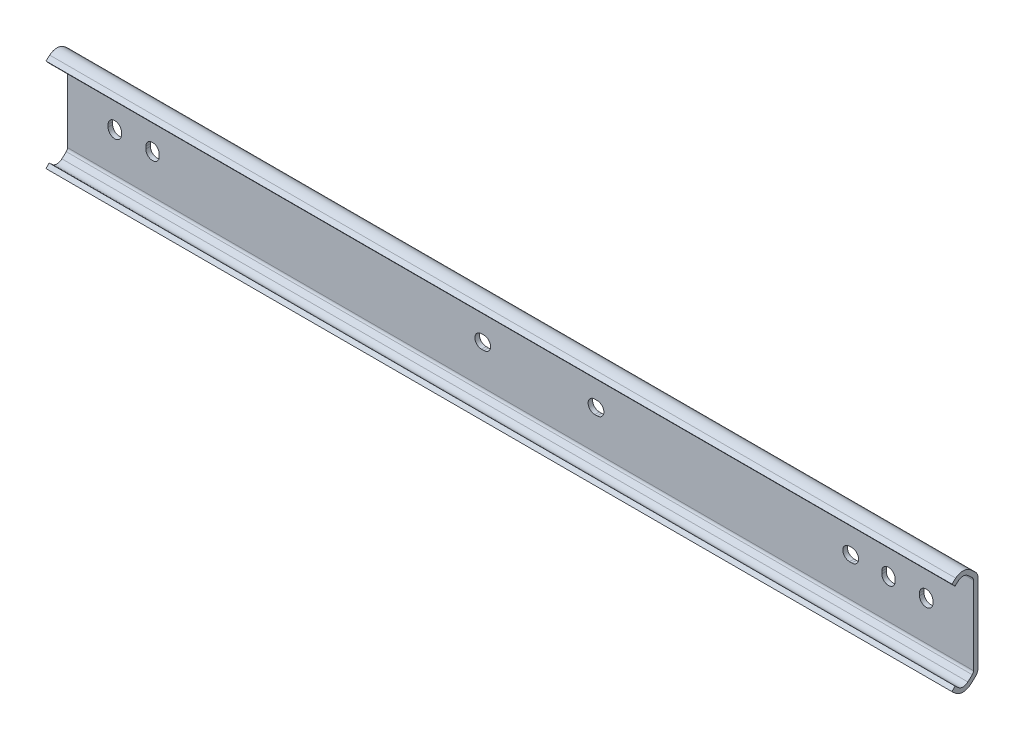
ISO-10303-21;
HEADER;
FILE_DESCRIPTION(('STEP AP214'),'2;1');
FILE_NAME('part.step','',(''),(''),'','','');
FILE_SCHEMA(('AUTOMOTIVE_DESIGN { 1 0 10303 214 1 1 1 1 }'));
ENDSEC;
DATA;
#1=APPLICATION_CONTEXT('core data for automotive mechanical design processes');
#2=APPLICATION_PROTOCOL_DEFINITION('international standard','automotive_design',2000,#1);
#3=PRODUCT_CONTEXT('',#1,'mechanical');
#4=PRODUCT('Part','Part','',(#3));
#5=PRODUCT_RELATED_PRODUCT_CATEGORY('part','',(#4));
#6=PRODUCT_DEFINITION_FORMATION('','',#4);
#7=PRODUCT_DEFINITION_CONTEXT('part definition',#1,'design');
#8=PRODUCT_DEFINITION('design','',#6,#7);
#9=PRODUCT_DEFINITION_SHAPE('','',#8);
#10=(LENGTH_UNIT() NAMED_UNIT(*) SI_UNIT(.MILLI.,.METRE.));
#11=(NAMED_UNIT(*) PLANE_ANGLE_UNIT() SI_UNIT($,.RADIAN.));
#12=(NAMED_UNIT(*) SI_UNIT($,.STERADIAN.) SOLID_ANGLE_UNIT());
#13=UNCERTAINTY_MEASURE_WITH_UNIT(LENGTH_MEASURE(1.E-05),#10,'distance_accuracy_value','');
#14=(GEOMETRIC_REPRESENTATION_CONTEXT(3) GLOBAL_UNCERTAINTY_ASSIGNED_CONTEXT((#13)) GLOBAL_UNIT_ASSIGNED_CONTEXT((#10,
#11,#12)) REPRESENTATION_CONTEXT('',''));
#15=CARTESIAN_POINT('',(0.,0.,0.));
#16=DIRECTION('',(0.,0.,1.));
#17=DIRECTION('',(1.,0.,0.));
#18=AXIS2_PLACEMENT_3D('',#15,#16,#17);
#19=CARTESIAN_POINT('',(-15.9,13.1771270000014,1.52400011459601));
#20=DIRECTION('',(0.,0.,1.));
#21=DIRECTION('',(-1.,0.,0.));
#22=AXIS2_PLACEMENT_3D('',#19,#20,#21);
#23=PLANE('',#22);
#24=DIRECTION('',(0.,-1.,0.));
#25=VECTOR('',#24,1.);
#26=CARTESIAN_POINT('',(-15.9,13.1771270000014,1.52400011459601));
#27=LINE('',#26,#25);
#28=CARTESIAN_POINT('',(-15.9,13.1771270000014,1.52400011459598));
#29=VERTEX_POINT('',#28);
#30=CARTESIAN_POINT('',(-15.9,-13.1771270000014,1.52400011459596));
#31=VERTEX_POINT('',#30);
#32=EDGE_CURVE('E691',#29,#31,#27,.T.);
#33=ORIENTED_EDGE('',*,*,#32,.T.);
#34=DIRECTION('',(-1.,0.,0.));
#35=VECTOR('',#34,1.);
#36=CARTESIAN_POINT('',(288.9,-13.1771270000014,1.52400011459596));
#37=LINE('',#36,#35);
#38=CARTESIAN_POINT('',(288.9,-13.1771270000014,1.52400011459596));
#39=VERTEX_POINT('',#38);
#40=EDGE_CURVE('E396',#39,#31,#37,.T.);
#41=ORIENTED_EDGE('',*,*,#40,.F.);
#42=DIRECTION('',(0.,-1.,0.));
#43=VECTOR('',#42,1.);
#44=CARTESIAN_POINT('',(288.9,13.1771270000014,1.52400011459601));
#45=LINE('',#44,#43);
#46=CARTESIAN_POINT('',(288.9,13.1771270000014,1.52400011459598));
#47=VERTEX_POINT('',#46);
#48=EDGE_CURVE('E661',#47,#39,#45,.T.);
#49=ORIENTED_EDGE('',*,*,#48,.F.);
#50=DIRECTION('',(1.,0.,0.));
#51=VECTOR('',#50,1.);
#52=CARTESIAN_POINT('',(-15.9,13.1771270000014,1.52400011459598));
#53=LINE('',#52,#51);
#54=EDGE_CURVE('E10',#29,#47,#53,.T.);
#55=ORIENTED_EDGE('',*,*,#54,.F.);
#56=EDGE_LOOP('',(#33,#41,#49,#55));
#57=FACE_BOUND('',#56,.T.);
#58=CARTESIAN_POINT('',(124.2,0.,1.52400011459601));
#59=DIRECTION('',(0.,0.,1.));
#60=DIRECTION('',(-1.,0.,0.));
#61=AXIS2_PLACEMENT_3D('',#58,#59,#60);
#62=CIRCLE('',#61,2.25);
#63=CARTESIAN_POINT('',(124.2,-2.25,1.52400011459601));
#64=VERTEX_POINT('',#63);
#65=CARTESIAN_POINT('',(124.2,2.25,1.52400011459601));
#66=VERTEX_POINT('',#65);
#67=EDGE_CURVE('E34',#64,#66,#62,.T.);
#68=ORIENTED_EDGE('',*,*,#67,.F.);
#69=DIRECTION('',(1.,0.,0.));
#70=VECTOR('',#69,1.);
#71=CARTESIAN_POINT('',(124.2,-2.25,1.52400011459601));
#72=LINE('',#71,#70);
#73=CARTESIAN_POINT('',(123.4,-2.25,1.52400011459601));
#74=VERTEX_POINT('',#73);
#75=EDGE_CURVE('E426',#74,#64,#72,.T.);
#76=ORIENTED_EDGE('',*,*,#75,.F.);
#77=CARTESIAN_POINT('',(123.4,0.,1.52400011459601));
#78=DIRECTION('',(0.,0.,1.));
#79=DIRECTION('',(-1.,0.,0.));
#80=AXIS2_PLACEMENT_3D('',#77,#78,#79);
#81=CIRCLE('',#80,2.25);
#82=CARTESIAN_POINT('',(123.4,2.25,1.52400011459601));
#83=VERTEX_POINT('',#82);
#84=EDGE_CURVE('E423',#83,#74,#81,.T.);
#85=ORIENTED_EDGE('',*,*,#84,.F.);
#86=DIRECTION('',(-1.,0.,0.));
#87=VECTOR('',#86,1.);
#88=CARTESIAN_POINT('',(123.4,2.25,1.52400011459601));
#89=LINE('',#88,#87);
#90=EDGE_CURVE('E421',#66,#83,#89,.T.);
#91=ORIENTED_EDGE('',*,*,#90,.F.);
#92=EDGE_LOOP('',(#68,#76,#85,#91));
#93=FACE_BOUND('',#92,.T.);
#94=CARTESIAN_POINT('',(162.3,0.,1.52400011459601));
#95=DIRECTION('',(0.,0.,1.));
#96=DIRECTION('',(-1.,0.,0.));
#97=AXIS2_PLACEMENT_3D('',#94,#95,#96);
#98=CIRCLE('',#97,2.25);
#99=CARTESIAN_POINT('',(162.3,-2.25,1.52400011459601));
#100=VERTEX_POINT('',#99);
#101=CARTESIAN_POINT('',(162.3,2.25,1.52400011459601));
#102=VERTEX_POINT('',#101);
#103=EDGE_CURVE('E448',#100,#102,#98,.T.);
#104=ORIENTED_EDGE('',*,*,#103,.F.);
#105=DIRECTION('',(1.,0.,0.));
#106=VECTOR('',#105,1.);
#107=CARTESIAN_POINT('',(162.3,-2.25,1.52400011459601));
#108=LINE('',#107,#106);
#109=CARTESIAN_POINT('',(161.5,-2.25,1.52400011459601));
#110=VERTEX_POINT('',#109);
#111=EDGE_CURVE('E456',#110,#100,#108,.T.);
#112=ORIENTED_EDGE('',*,*,#111,.F.);
#113=CARTESIAN_POINT('',(161.5,0.,1.52400011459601));
#114=DIRECTION('',(0.,0.,1.));
#115=DIRECTION('',(-1.,0.,0.));
#116=AXIS2_PLACEMENT_3D('',#113,#114,#115);
#117=CIRCLE('',#116,2.25);
#118=CARTESIAN_POINT('',(161.5,2.25,1.52400011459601));
#119=VERTEX_POINT('',#118);
#120=EDGE_CURVE('E453',#119,#110,#117,.T.);
#121=ORIENTED_EDGE('',*,*,#120,.F.);
#122=DIRECTION('',(-1.,0.,0.));
#123=VECTOR('',#122,1.);
#124=CARTESIAN_POINT('',(161.5,2.25,1.52400011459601));
#125=LINE('',#124,#123);
#126=EDGE_CURVE('E450',#102,#119,#125,.T.);
#127=ORIENTED_EDGE('',*,*,#126,.F.);
#128=EDGE_LOOP('',(#104,#112,#121,#127));
#129=FACE_BOUND('',#128,.T.);
#130=CARTESIAN_POINT('',(248.,0.,1.52400011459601));
#131=DIRECTION('',(0.,0.,1.));
#132=DIRECTION('',(-1.,0.,0.));
#133=AXIS2_PLACEMENT_3D('',#130,#131,#132);
#134=CIRCLE('',#133,2.25);
#135=CARTESIAN_POINT('',(248.,-2.25,1.52400011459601));
#136=VERTEX_POINT('',#135);
#137=CARTESIAN_POINT('',(248.,2.25,1.52400011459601));
#138=VERTEX_POINT('',#137);
#139=EDGE_CURVE('E480',#136,#138,#134,.T.);
#140=ORIENTED_EDGE('',*,*,#139,.F.);
#141=DIRECTION('',(1.,0.,0.));
#142=VECTOR('',#141,1.);
#143=CARTESIAN_POINT('',(248.,-2.25,1.52400011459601));
#144=LINE('',#143,#142);
#145=CARTESIAN_POINT('',(247.2,-2.25,1.52400011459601));
#146=VERTEX_POINT('',#145);
#147=EDGE_CURVE('E488',#146,#136,#144,.T.);
#148=ORIENTED_EDGE('',*,*,#147,.F.);
#149=CARTESIAN_POINT('',(247.2,0.,1.52400011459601));
#150=DIRECTION('',(0.,0.,1.));
#151=DIRECTION('',(-1.,0.,0.));
#152=AXIS2_PLACEMENT_3D('',#149,#150,#151);
#153=CIRCLE('',#152,2.25);
#154=CARTESIAN_POINT('',(247.2,2.25,1.52400011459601));
#155=VERTEX_POINT('',#154);
#156=EDGE_CURVE('E485',#155,#146,#153,.T.);
#157=ORIENTED_EDGE('',*,*,#156,.F.);
#158=DIRECTION('',(-1.,0.,0.));
#159=VECTOR('',#158,1.);
#160=CARTESIAN_POINT('',(247.2,2.25,1.52400011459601));
#161=LINE('',#160,#159);
#162=EDGE_CURVE('E482',#138,#155,#161,.T.);
#163=ORIENTED_EDGE('',*,*,#162,.F.);
#164=EDGE_LOOP('',(#140,#148,#157,#163));
#165=FACE_BOUND('',#164,.T.);
#166=CARTESIAN_POINT('',(273.,-0.4,1.52400011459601));
#167=DIRECTION('',(0.,0.,1.));
#168=DIRECTION('',(-1.,0.,0.));
#169=AXIS2_PLACEMENT_3D('',#166,#167,#168);
#170=CIRCLE('',#169,2.24999999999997);
#171=CARTESIAN_POINT('',(270.75,-0.4,1.52400011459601));
#172=VERTEX_POINT('',#171);
#173=CARTESIAN_POINT('',(275.25,-0.4,1.52400011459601));
#174=VERTEX_POINT('',#173);
#175=EDGE_CURVE('E512',#172,#174,#170,.T.);
#176=ORIENTED_EDGE('',*,*,#175,.F.);
#177=DIRECTION('',(0.,-1.,0.));
#178=VECTOR('',#177,1.);
#179=CARTESIAN_POINT('',(270.75,-0.4,1.52400011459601));
#180=LINE('',#179,#178);
#181=CARTESIAN_POINT('',(270.75,0.4,1.52400011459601));
#182=VERTEX_POINT('',#181);
#183=EDGE_CURVE('E520',#182,#172,#180,.T.);
#184=ORIENTED_EDGE('',*,*,#183,.F.);
#185=CARTESIAN_POINT('',(273.,0.4,1.52400011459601));
#186=DIRECTION('',(0.,0.,1.));
#187=DIRECTION('',(-1.,0.,0.));
#188=AXIS2_PLACEMENT_3D('',#185,#186,#187);
#189=CIRCLE('',#188,2.24999999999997);
#190=CARTESIAN_POINT('',(275.25,0.4,1.52400011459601));
#191=VERTEX_POINT('',#190);
#192=EDGE_CURVE('E517',#191,#182,#189,.T.);
#193=ORIENTED_EDGE('',*,*,#192,.F.);
#194=DIRECTION('',(0.,1.,0.));
#195=VECTOR('',#194,1.);
#196=CARTESIAN_POINT('',(275.25,0.4,1.52400011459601));
#197=LINE('',#196,#195);
#198=EDGE_CURVE('E514',#174,#191,#197,.T.);
#199=ORIENTED_EDGE('',*,*,#198,.F.);
#200=EDGE_LOOP('',(#176,#184,#193,#199));
#201=FACE_BOUND('',#200,.T.);
#202=CARTESIAN_POINT('',(260.3,-0.4,1.52400011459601));
#203=DIRECTION('',(0.,0.,1.));
#204=DIRECTION('',(-1.,0.,0.));
#205=AXIS2_PLACEMENT_3D('',#202,#203,#204);
#206=CIRCLE('',#205,2.24999999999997);
#207=CARTESIAN_POINT('',(258.05,-0.4,1.52400011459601));
#208=VERTEX_POINT('',#207);
#209=CARTESIAN_POINT('',(262.55,-0.4,1.52400011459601));
#210=VERTEX_POINT('',#209);
#211=EDGE_CURVE('E544',#208,#210,#206,.T.);
#212=ORIENTED_EDGE('',*,*,#211,.F.);
#213=DIRECTION('',(0.,-1.,0.));
#214=VECTOR('',#213,1.);
#215=CARTESIAN_POINT('',(258.05,-0.4,1.52400011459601));
#216=LINE('',#215,#214);
#217=CARTESIAN_POINT('',(258.05,0.4,1.52400011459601));
#218=VERTEX_POINT('',#217);
#219=EDGE_CURVE('E552',#218,#208,#216,.T.);
#220=ORIENTED_EDGE('',*,*,#219,.F.);
#221=CARTESIAN_POINT('',(260.3,0.4,1.52400011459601));
#222=DIRECTION('',(0.,0.,1.));
#223=DIRECTION('',(-1.,0.,0.));
#224=AXIS2_PLACEMENT_3D('',#221,#222,#223);
#225=CIRCLE('',#224,2.24999999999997);
#226=CARTESIAN_POINT('',(262.55,0.4,1.52400011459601));
#227=VERTEX_POINT('',#226);
#228=EDGE_CURVE('E549',#227,#218,#225,.T.);
#229=ORIENTED_EDGE('',*,*,#228,.F.);
#230=DIRECTION('',(0.,1.,0.));
#231=VECTOR('',#230,1.);
#232=CARTESIAN_POINT('',(262.55,0.4,1.52400011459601));
#233=LINE('',#232,#231);
#234=EDGE_CURVE('E546',#210,#227,#233,.T.);
#235=ORIENTED_EDGE('',*,*,#234,.F.);
#236=EDGE_LOOP('',(#212,#220,#229,#235));
#237=FACE_BOUND('',#236,.T.);
#238=CARTESIAN_POINT('',(12.7,-0.4,1.52400011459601));
#239=DIRECTION('',(0.,0.,1.));
#240=DIRECTION('',(-1.,0.,0.));
#241=AXIS2_PLACEMENT_3D('',#238,#239,#240);
#242=CIRCLE('',#241,2.24999999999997);
#243=CARTESIAN_POINT('',(10.45,-0.4,1.52400011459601));
#244=VERTEX_POINT('',#243);
#245=CARTESIAN_POINT('',(14.95,-0.4,1.52400011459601));
#246=VERTEX_POINT('',#245);
#247=EDGE_CURVE('E576',#244,#246,#242,.T.);
#248=ORIENTED_EDGE('',*,*,#247,.F.);
#249=DIRECTION('',(0.,-1.,0.));
#250=VECTOR('',#249,1.);
#251=CARTESIAN_POINT('',(10.45,-0.4,1.52400011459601));
#252=LINE('',#251,#250);
#253=CARTESIAN_POINT('',(10.45,0.4,1.52400011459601));
#254=VERTEX_POINT('',#253);
#255=EDGE_CURVE('E584',#254,#244,#252,.T.);
#256=ORIENTED_EDGE('',*,*,#255,.F.);
#257=CARTESIAN_POINT('',(12.7,0.4,1.52400011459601));
#258=DIRECTION('',(0.,0.,1.));
#259=DIRECTION('',(-1.,0.,0.));
#260=AXIS2_PLACEMENT_3D('',#257,#258,#259);
#261=CIRCLE('',#260,2.24999999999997);
#262=CARTESIAN_POINT('',(14.95,0.4,1.52400011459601));
#263=VERTEX_POINT('',#262);
#264=EDGE_CURVE('E581',#263,#254,#261,.T.);
#265=ORIENTED_EDGE('',*,*,#264,.F.);
#266=DIRECTION('',(0.,1.,0.));
#267=VECTOR('',#266,1.);
#268=CARTESIAN_POINT('',(14.95,0.4,1.52400011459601));
#269=LINE('',#268,#267);
#270=EDGE_CURVE('E578',#246,#263,#269,.T.);
#271=ORIENTED_EDGE('',*,*,#270,.F.);
#272=EDGE_LOOP('',(#248,#256,#265,#271));
#273=FACE_BOUND('',#272,.T.);
#274=CARTESIAN_POINT('',(0.,-0.4,1.52400011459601));
#275=DIRECTION('',(0.,0.,1.));
#276=DIRECTION('',(-1.,0.,0.));
#277=AXIS2_PLACEMENT_3D('',#274,#275,#276);
#278=CIRCLE('',#277,2.24999999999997);
#279=CARTESIAN_POINT('',(-2.25000000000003,-0.4,1.52400011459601));
#280=VERTEX_POINT('',#279);
#281=CARTESIAN_POINT('',(2.24999999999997,-0.4,1.52400011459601));
#282=VERTEX_POINT('',#281);
#283=EDGE_CURVE('E608',#280,#282,#278,.T.);
#284=ORIENTED_EDGE('',*,*,#283,.F.);
#285=DIRECTION('',(0.,-1.,0.));
#286=VECTOR('',#285,1.);
#287=CARTESIAN_POINT('',(-2.25000000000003,-0.4,1.52400011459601));
#288=LINE('',#287,#286);
#289=CARTESIAN_POINT('',(-2.25000000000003,0.4,1.52400011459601));
#290=VERTEX_POINT('',#289);
#291=EDGE_CURVE('E616',#290,#280,#288,.T.);
#292=ORIENTED_EDGE('',*,*,#291,.F.);
#293=CARTESIAN_POINT('',(0.,0.4,1.52400011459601));
#294=DIRECTION('',(0.,0.,1.));
#295=DIRECTION('',(-1.,0.,0.));
#296=AXIS2_PLACEMENT_3D('',#293,#294,#295);
#297=CIRCLE('',#296,2.24999999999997);
#298=CARTESIAN_POINT('',(2.24999999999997,0.4,1.52400011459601));
#299=VERTEX_POINT('',#298);
#300=EDGE_CURVE('E613',#299,#290,#297,.T.);
#301=ORIENTED_EDGE('',*,*,#300,.F.);
#302=DIRECTION('',(0.,1.,0.));
#303=VECTOR('',#302,1.);
#304=CARTESIAN_POINT('',(2.24999999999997,0.4,1.52400011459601));
#305=LINE('',#304,#303);
#306=EDGE_CURVE('E610',#282,#299,#305,.T.);
#307=ORIENTED_EDGE('',*,*,#306,.F.);
#308=EDGE_LOOP('',(#284,#292,#301,#307));
#309=FACE_BOUND('',#308,.T.);
#310=ADVANCED_FACE('F17',(#57,#93,#129,#165,#201,#237,#273,#309),#23,.T.);
#311=CARTESIAN_POINT('',(-15.9,13.1771270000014,2.82399974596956));
#312=DIRECTION('',(1.,0.,0.));
#313=DIRECTION('',(0.,0.,1.));
#314=AXIS2_PLACEMENT_3D('',#311,#312,#313);
#315=CYLINDRICAL_SURFACE('',#314,1.29999963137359);
#316=CARTESIAN_POINT('',(288.9,13.1771270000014,2.82399974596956));
#317=DIRECTION('',(-1.,0.,0.));
#318=DIRECTION('',(0.,0.,-1.));
#319=AXIS2_PLACEMENT_3D('',#316,#317,#318);
#320=CIRCLE('',#319,1.29999963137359);
#321=CARTESIAN_POINT('',(288.9,14.1308812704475,1.94062449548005));
#322=VERTEX_POINT('',#321);
#323=EDGE_CURVE('E658',#322,#47,#320,.T.);
#324=ORIENTED_EDGE('',*,*,#323,.F.);
#325=DIRECTION('',(1.,0.,0.));
#326=VECTOR('',#325,1.);
#327=CARTESIAN_POINT('',(-15.9,14.1308812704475,1.94062449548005));
#328=LINE('',#327,#326);
#329=CARTESIAN_POINT('',(-15.9,14.1308812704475,1.94062449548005));
#330=VERTEX_POINT('',#329);
#331=EDGE_CURVE('E26',#330,#322,#328,.T.);
#332=ORIENTED_EDGE('',*,*,#331,.F.);
#333=CARTESIAN_POINT('',(-15.9,13.1771270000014,2.82399974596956));
#334=DIRECTION('',(-1.,0.,0.));
#335=DIRECTION('',(0.,0.,-1.));
#336=AXIS2_PLACEMENT_3D('',#333,#334,#335);
#337=CIRCLE('',#336,1.29999963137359);
#338=EDGE_CURVE('E688',#330,#29,#337,.T.);
#339=ORIENTED_EDGE('',*,*,#338,.T.);
#340=ORIENTED_EDGE('',*,*,#54,.T.);
#341=EDGE_LOOP('',(#324,#332,#339,#340));
#342=FACE_BOUND('',#341,.T.);
#343=ADVANCED_FACE('F747',(#342),#315,.F.);
#344=CARTESIAN_POINT('',(-15.9,15.4973237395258,3.41593142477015));
#345=DIRECTION('',(0.,-0.733657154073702,0.679519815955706));
#346=DIRECTION('',(0.,-0.679519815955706,-0.733657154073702));
#347=AXIS2_PLACEMENT_3D('',#344,#345,#346);
#348=PLANE('',#347);
#349=DIRECTION('',(0.,-0.679519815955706,-0.733657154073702));
#350=VECTOR('',#349,1.);
#351=CARTESIAN_POINT('',(288.9,15.4973237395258,3.41593142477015));
#352=LINE('',#351,#350);
#353=CARTESIAN_POINT('',(288.9,15.4973237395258,3.41593142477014));
#354=VERTEX_POINT('',#353);
#355=EDGE_CURVE('E655',#354,#322,#352,.T.);
#356=ORIENTED_EDGE('',*,*,#355,.F.);
#357=DIRECTION('',(1.,0.,0.));
#358=VECTOR('',#357,1.);
#359=CARTESIAN_POINT('',(-15.9,15.4973237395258,3.41593142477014));
#360=LINE('',#359,#358);
#361=CARTESIAN_POINT('',(-15.9,15.4973237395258,3.41593142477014));
#362=VERTEX_POINT('',#361);
#363=EDGE_CURVE('E694',#362,#354,#360,.T.);
#364=ORIENTED_EDGE('',*,*,#363,.F.);
#365=DIRECTION('',(0.,-0.679519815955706,-0.733657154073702));
#366=VECTOR('',#365,1.);
#367=CARTESIAN_POINT('',(-15.9,15.4973237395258,3.41593142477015));
#368=LINE('',#367,#366);
#369=EDGE_CURVE('E685',#362,#330,#368,.T.);
#370=ORIENTED_EDGE('',*,*,#369,.T.);
#371=ORIENTED_EDGE('',*,*,#331,.T.);
#372=EDGE_LOOP('',(#356,#364,#370,#371));
#373=FACE_BOUND('',#372,.T.);
#374=ADVANCED_FACE('F743',(#373),#348,.T.);
#375=CARTESIAN_POINT('',(-15.9,13.745000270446,5.04999949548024));
#376=DIRECTION('',(1.,0.,0.));
#377=DIRECTION('',(0.,0.,1.));
#378=AXIS2_PLACEMENT_3D('',#375,#376,#377);
#379=CYLINDRICAL_SURFACE('',#378,2.39600000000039);
#380=CARTESIAN_POINT('',(288.9,13.745000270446,5.04999949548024));
#381=DIRECTION('',(-1.,0.,0.));
#382=DIRECTION('',(0.,0.,-1.));
#383=AXIS2_PLACEMENT_3D('',#380,#381,#382);
#384=CIRCLE('',#383,2.39600000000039);
#385=CARTESIAN_POINT('',(288.9,15.4018251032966,6.78082226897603));
#386=VERTEX_POINT('',#385);
#387=EDGE_CURVE('E652',#386,#354,#384,.T.);
#388=ORIENTED_EDGE('',*,*,#387,.F.);
#389=DIRECTION('',(1.,0.,0.));
#390=VECTOR('',#389,1.);
#391=CARTESIAN_POINT('',(-15.9,15.4018251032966,6.78082226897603));
#392=LINE('',#391,#390);
#393=CARTESIAN_POINT('',(-15.9,15.4018251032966,6.78082226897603));
#394=VERTEX_POINT('',#393);
#395=EDGE_CURVE('E696',#394,#386,#392,.T.);
#396=ORIENTED_EDGE('',*,*,#395,.F.);
#397=CARTESIAN_POINT('',(-15.9,13.745000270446,5.04999949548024));
#398=DIRECTION('',(-1.,0.,0.));
#399=DIRECTION('',(0.,0.,-1.));
#400=AXIS2_PLACEMENT_3D('',#397,#398,#399);
#401=CIRCLE('',#400,2.39600000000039);
#402=EDGE_CURVE('E682',#394,#362,#401,.T.);
#403=ORIENTED_EDGE('',*,*,#402,.T.);
#404=ORIENTED_EDGE('',*,*,#363,.T.);
#405=EDGE_LOOP('',(#388,#396,#403,#404));
#406=FACE_BOUND('',#405,.T.);
#407=ADVANCED_FACE('F739',(#406),#379,.F.);
#408=CARTESIAN_POINT('',(-15.9,15.4018251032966,6.78082226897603));
#409=DIRECTION('',(0.,-0.741021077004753,-0.671481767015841));
#410=DIRECTION('',(0.,0.671481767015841,-0.741021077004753));
#411=AXIS2_PLACEMENT_3D('',#408,#409,#410);
#412=PLANE('',#411);
#413=DIRECTION('',(0.,0.671481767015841,-0.741021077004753));
#414=VECTOR('',#413,1.);
#415=CARTESIAN_POINT('',(288.9,15.4018251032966,6.78082226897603));
#416=LINE('',#415,#414);
#417=CARTESIAN_POINT('',(288.9,14.5356842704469,7.73666149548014));
#418=VERTEX_POINT('',#417);
#419=EDGE_CURVE('E649',#418,#386,#416,.T.);
#420=ORIENTED_EDGE('',*,*,#419,.F.);
#421=DIRECTION('',(1.,0.,0.));
#422=VECTOR('',#421,1.);
#423=CARTESIAN_POINT('',(-15.9,14.5356842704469,7.73666149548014));
#424=LINE('',#423,#422);
#425=CARTESIAN_POINT('',(-15.9,14.5356842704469,7.73666149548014));
#426=VERTEX_POINT('',#425);
#427=EDGE_CURVE('E698',#426,#418,#424,.T.);
#428=ORIENTED_EDGE('',*,*,#427,.F.);
#429=DIRECTION('',(0.,0.671481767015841,-0.741021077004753));
#430=VECTOR('',#429,1.);
#431=CARTESIAN_POINT('',(-15.9,15.4018251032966,6.78082226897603));
#432=LINE('',#431,#430);
#433=EDGE_CURVE('E679',#426,#394,#432,.T.);
#434=ORIENTED_EDGE('',*,*,#433,.T.);
#435=ORIENTED_EDGE('',*,*,#395,.T.);
#436=EDGE_LOOP('',(#420,#428,#434,#435));
#437=FACE_BOUND('',#436,.T.);
#438=ADVANCED_FACE('F735',(#437),#412,.T.);
#439=CARTESIAN_POINT('',(-15.9,14.5356842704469,7.73666149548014));
#440=DIRECTION('',(0.,-0.671481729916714,0.741021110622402));
#441=DIRECTION('',(0.,-0.741021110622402,-0.671481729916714));
#442=AXIS2_PLACEMENT_3D('',#439,#440,#441);
#443=PLANE('',#442);
#444=DIRECTION('',(0.,-0.741021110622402,-0.671481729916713));
#445=VECTOR('',#444,1.);
#446=CARTESIAN_POINT('',(288.9,14.5356842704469,7.73666149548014));
#447=LINE('',#446,#445);
#448=CARTESIAN_POINT('',(288.9,15.6649899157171,8.75999011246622));
#449=VERTEX_POINT('',#448);
#450=EDGE_CURVE('E646',#449,#418,#447,.T.);
#451=ORIENTED_EDGE('',*,*,#450,.F.);
#452=DIRECTION('',(1.,0.,0.));
#453=VECTOR('',#452,1.);
#454=CARTESIAN_POINT('',(-15.9,15.6649899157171,8.75999011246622));
#455=LINE('',#454,#453);
#456=CARTESIAN_POINT('',(-15.9,15.6649899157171,8.75999011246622));
#457=VERTEX_POINT('',#456);
#458=EDGE_CURVE('E700',#457,#449,#455,.T.);
#459=ORIENTED_EDGE('',*,*,#458,.F.);
#460=DIRECTION('',(0.,-0.741021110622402,-0.671481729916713));
#461=VECTOR('',#460,1.);
#462=CARTESIAN_POINT('',(-15.9,14.5356842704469,7.73666149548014));
#463=LINE('',#462,#461);
#464=EDGE_CURVE('E676',#457,#426,#463,.T.);
#465=ORIENTED_EDGE('',*,*,#464,.T.);
#466=ORIENTED_EDGE('',*,*,#427,.T.);
#467=EDGE_LOOP('',(#451,#459,#465,#466));
#468=FACE_BOUND('',#467,.T.);
#469=ADVANCED_FACE('F731',(#468),#443,.T.);
#470=CARTESIAN_POINT('',(-15.9,16.7914015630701,7.51692662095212));
#471=DIRECTION('',(0.,0.741020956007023,0.671481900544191));
#472=DIRECTION('',(0.,-0.671481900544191,0.741020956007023));
#473=AXIS2_PLACEMENT_3D('',#470,#471,#472);
#474=PLANE('',#473);
#475=DIRECTION('',(0.,-0.671481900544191,0.741020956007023));
#476=VECTOR('',#475,1.);
#477=CARTESIAN_POINT('',(288.9,16.7914015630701,7.51692662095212));
#478=LINE('',#477,#476);
#479=CARTESIAN_POINT('',(288.9,16.7914015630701,7.5169266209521));
#480=VERTEX_POINT('',#479);
#481=EDGE_CURVE('E643',#480,#449,#478,.T.);
#482=ORIENTED_EDGE('',*,*,#481,.F.);
#483=DIRECTION('',(1.,0.,0.));
#484=VECTOR('',#483,1.);
#485=CARTESIAN_POINT('',(-15.9,16.7914015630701,7.5169266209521));
#486=LINE('',#485,#484);
#487=CARTESIAN_POINT('',(-15.9,16.7914015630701,7.5169266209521));
#488=VERTEX_POINT('',#487);
#489=EDGE_CURVE('E702',#488,#480,#486,.T.);
#490=ORIENTED_EDGE('',*,*,#489,.F.);
#491=DIRECTION('',(0.,-0.671481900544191,0.741020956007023));
#492=VECTOR('',#491,1.);
#493=CARTESIAN_POINT('',(-15.9,16.7914015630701,7.51692662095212));
#494=LINE('',#493,#492);
#495=EDGE_CURVE('E673',#488,#457,#494,.T.);
#496=ORIENTED_EDGE('',*,*,#495,.T.);
#497=ORIENTED_EDGE('',*,*,#458,.T.);
#498=EDGE_LOOP('',(#482,#490,#496,#497));
#499=FACE_BOUND('',#498,.T.);
#500=ADVANCED_FACE('F727',(#499),#474,.T.);
#501=CARTESIAN_POINT('',(-15.9,13.745000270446,5.04999949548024));
#502=DIRECTION('',(1.,0.,0.));
#503=DIRECTION('',(0.,0.,1.));
#504=AXIS2_PLACEMENT_3D('',#501,#502,#503);
#505=CYLINDRICAL_SURFACE('',#504,3.91998600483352);
#506=CARTESIAN_POINT('',(288.9,13.745000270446,5.04999949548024));
#507=DIRECTION('',(1.,0.,0.));
#508=DIRECTION('',(0.,0.,-1.));
#509=AXIS2_PLACEMENT_3D('',#506,#507,#508);
#510=CIRCLE('',#509,3.91998600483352);
#511=CARTESIAN_POINT('',(288.9,16.620926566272,2.38629188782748));
#512=VERTEX_POINT('',#511);
#513=EDGE_CURVE('E640',#512,#480,#510,.T.);
#514=ORIENTED_EDGE('',*,*,#513,.F.);
#515=DIRECTION('',(1.,0.,0.));
#516=VECTOR('',#515,1.);
#517=CARTESIAN_POINT('',(-15.9,16.620926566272,2.38629188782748));
#518=LINE('',#517,#516);
#519=CARTESIAN_POINT('',(-15.9,16.620926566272,2.38629188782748));
#520=VERTEX_POINT('',#519);
#521=EDGE_CURVE('E704',#520,#512,#518,.T.);
#522=ORIENTED_EDGE('',*,*,#521,.F.);
#523=CARTESIAN_POINT('',(-15.9,13.745000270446,5.04999949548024));
#524=DIRECTION('',(1.,0.,0.));
#525=DIRECTION('',(0.,0.,-1.));
#526=AXIS2_PLACEMENT_3D('',#523,#524,#525);
#527=CIRCLE('',#526,3.91998600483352);
#528=EDGE_CURVE('E670',#520,#488,#527,.T.);
#529=ORIENTED_EDGE('',*,*,#528,.T.);
#530=ORIENTED_EDGE('',*,*,#489,.T.);
#531=EDGE_LOOP('',(#514,#522,#529,#530));
#532=FACE_BOUND('',#531,.T.);
#533=ADVANCED_FACE('F723',(#532),#505,.T.);
#534=CARTESIAN_POINT('',(-15.9,16.620926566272,2.38629188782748));
#535=DIRECTION('',(0.,0.73365728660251,-0.679519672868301));
#536=DIRECTION('',(0.,0.679519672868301,0.73365728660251));
#537=AXIS2_PLACEMENT_3D('',#534,#535,#536);
#538=PLANE('',#537);
#539=DIRECTION('',(0.,0.679519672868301,0.73365728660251));
#540=VECTOR('',#539,1.);
#541=CARTESIAN_POINT('',(288.9,16.620926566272,2.38629188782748));
#542=LINE('',#541,#540);
#543=CARTESIAN_POINT('',(288.9,15.2489749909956,0.90503636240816));
#544=VERTEX_POINT('',#543);
#545=EDGE_CURVE('E638',#544,#512,#542,.T.);
#546=ORIENTED_EDGE('',*,*,#545,.F.);
#547=DIRECTION('',(1.,0.,0.));
#548=VECTOR('',#547,1.);
#549=CARTESIAN_POINT('',(-15.9,15.2489749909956,0.90503636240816));
#550=LINE('',#549,#548);
#551=CARTESIAN_POINT('',(-15.9,15.2489749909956,0.90503636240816));
#552=VERTEX_POINT('',#551);
#553=EDGE_CURVE('E706',#552,#544,#550,.T.);
#554=ORIENTED_EDGE('',*,*,#553,.F.);
#555=DIRECTION('',(0.,0.679519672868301,0.73365728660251));
#556=VECTOR('',#555,1.);
#557=CARTESIAN_POINT('',(-15.9,16.620926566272,2.38629188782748));
#558=LINE('',#557,#556);
#559=EDGE_CURVE('E668',#552,#520,#558,.T.);
#560=ORIENTED_EDGE('',*,*,#559,.T.);
#561=ORIENTED_EDGE('',*,*,#521,.T.);
#562=EDGE_LOOP('',(#546,#554,#560,#561));
#563=FACE_BOUND('',#562,.T.);
#564=ADVANCED_FACE('F719',(#563),#538,.T.);
#565=CARTESIAN_POINT('',(-15.9,13.1771270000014,2.82399974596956));
#566=DIRECTION('',(1.,0.,0.));
#567=DIRECTION('',(0.,0.,1.));
#568=AXIS2_PLACEMENT_3D('',#565,#566,#567);
#569=CYLINDRICAL_SURFACE('',#568,2.82399974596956);
#570=CARTESIAN_POINT('',(288.9,13.1771270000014,2.82399974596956));
#571=DIRECTION('',(1.,0.,0.));
#572=DIRECTION('',(0.,0.,-1.));
#573=AXIS2_PLACEMENT_3D('',#570,#571,#572);
#574=CIRCLE('',#573,2.82399974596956);
#575=CARTESIAN_POINT('',(288.9,13.1771270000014,0.));
#576=VERTEX_POINT('',#575);
#577=EDGE_CURVE('E634',#576,#544,#574,.T.);
#578=ORIENTED_EDGE('',*,*,#577,.F.);
#579=DIRECTION('',(1.,0.,0.));
#580=VECTOR('',#579,1.);
#581=CARTESIAN_POINT('',(-15.9,13.1771270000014,0.));
#582=LINE('',#581,#580);
#583=CARTESIAN_POINT('',(-15.9,13.1771270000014,0.));
#584=VERTEX_POINT('',#583);
#585=EDGE_CURVE('E21',#584,#576,#582,.T.);
#586=ORIENTED_EDGE('',*,*,#585,.F.);
#587=CARTESIAN_POINT('',(-15.9,13.1771270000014,2.82399974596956));
#588=DIRECTION('',(1.,0.,0.));
#589=DIRECTION('',(0.,0.,-1.));
#590=AXIS2_PLACEMENT_3D('',#587,#588,#589);
#591=CIRCLE('',#590,2.82399974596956);
#592=EDGE_CURVE('E665',#584,#552,#591,.T.);
#593=ORIENTED_EDGE('',*,*,#592,.T.);
#594=ORIENTED_EDGE('',*,*,#553,.T.);
#595=EDGE_LOOP('',(#578,#586,#593,#594));
#596=FACE_BOUND('',#595,.T.);
#597=ADVANCED_FACE('F715',(#596),#569,.T.);
#598=CARTESIAN_POINT('',(-15.9,13.1771270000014,0.));
#599=DIRECTION('',(0.,0.,-1.));
#600=DIRECTION('',(1.,0.,0.));
#601=AXIS2_PLACEMENT_3D('',#598,#599,#600);
#602=PLANE('',#601);
#603=ORIENTED_EDGE('',*,*,#585,.T.);
#604=DIRECTION('',(0.,1.,0.));
#605=VECTOR('',#604,1.);
#606=CARTESIAN_POINT('',(288.9,13.1771270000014,0.));
#607=LINE('',#606,#605);
#608=CARTESIAN_POINT('',(288.9,-13.1771270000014,0.));
#609=VERTEX_POINT('',#608);
#610=EDGE_CURVE('E631',#609,#576,#607,.T.);
#611=ORIENTED_EDGE('',*,*,#610,.F.);
#612=DIRECTION('',(-1.,0.,0.));
#613=VECTOR('',#612,1.);
#614=CARTESIAN_POINT('',(288.9,-13.1771270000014,0.));
#615=LINE('',#614,#613);
#616=CARTESIAN_POINT('',(-15.9,-13.1771270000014,0.));
#617=VERTEX_POINT('',#616);
#618=EDGE_CURVE('E349',#609,#617,#615,.T.);
#619=ORIENTED_EDGE('',*,*,#618,.T.);
#620=DIRECTION('',(0.,1.,0.));
#621=VECTOR('',#620,1.);
#622=CARTESIAN_POINT('',(-15.9,13.1771270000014,0.));
#623=LINE('',#622,#621);
#624=EDGE_CURVE('E663',#617,#584,#623,.T.);
#625=ORIENTED_EDGE('',*,*,#624,.T.);
#626=EDGE_LOOP('',(#603,#611,#619,#625));
#627=FACE_BOUND('',#626,.T.);
#628=CARTESIAN_POINT('',(124.2,0.,0.));
#629=DIRECTION('',(0.,0.,-1.));
#630=DIRECTION('',(1.,0.,0.));
#631=AXIS2_PLACEMENT_3D('',#628,#629,#630);
#632=CIRCLE('',#631,2.25);
#633=CARTESIAN_POINT('',(124.2,-2.25,0.));
#634=VERTEX_POINT('',#633);
#635=CARTESIAN_POINT('',(124.2,2.25,0.));
#636=VERTEX_POINT('',#635);
#637=EDGE_CURVE('E417',#634,#636,#632,.F.);
#638=ORIENTED_EDGE('',*,*,#637,.T.);
#639=DIRECTION('',(-1.,0.,0.));
#640=VECTOR('',#639,1.);
#641=CARTESIAN_POINT('',(123.4,2.25,0.));
#642=LINE('',#641,#640);
#643=CARTESIAN_POINT('',(123.4,2.25,0.));
#644=VERTEX_POINT('',#643);
#645=EDGE_CURVE('E432',#636,#644,#642,.T.);
#646=ORIENTED_EDGE('',*,*,#645,.T.);
#647=CARTESIAN_POINT('',(123.4,0.,0.));
#648=DIRECTION('',(0.,0.,-1.));
#649=DIRECTION('',(1.,0.,0.));
#650=AXIS2_PLACEMENT_3D('',#647,#648,#649);
#651=CIRCLE('',#650,2.25);
#652=CARTESIAN_POINT('',(123.4,-2.25,0.));
#653=VERTEX_POINT('',#652);
#654=EDGE_CURVE('E395',#644,#653,#651,.F.);
#655=ORIENTED_EDGE('',*,*,#654,.T.);
#656=DIRECTION('',(1.,0.,0.));
#657=VECTOR('',#656,1.);
#658=CARTESIAN_POINT('',(124.2,-2.25,0.));
#659=LINE('',#658,#657);
#660=EDGE_CURVE('E414',#653,#634,#659,.T.);
#661=ORIENTED_EDGE('',*,*,#660,.T.);
#662=EDGE_LOOP('',(#638,#646,#655,#661));
#663=FACE_BOUND('',#662,.T.);
#664=CARTESIAN_POINT('',(162.3,0.,0.));
#665=DIRECTION('',(0.,0.,-1.));
#666=DIRECTION('',(1.,0.,0.));
#667=AXIS2_PLACEMENT_3D('',#664,#665,#666);
#668=CIRCLE('',#667,2.25);
#669=CARTESIAN_POINT('',(162.3,-2.25,0.));
#670=VERTEX_POINT('',#669);
#671=CARTESIAN_POINT('',(162.3,2.25,0.));
#672=VERTEX_POINT('',#671);
#673=EDGE_CURVE('E445',#670,#672,#668,.F.);
#674=ORIENTED_EDGE('',*,*,#673,.T.);
#675=DIRECTION('',(-1.,0.,0.));
#676=VECTOR('',#675,1.);
#677=CARTESIAN_POINT('',(161.5,2.25,0.));
#678=LINE('',#677,#676);
#679=CARTESIAN_POINT('',(161.5,2.25,0.));
#680=VERTEX_POINT('',#679);
#681=EDGE_CURVE('E462',#672,#680,#678,.T.);
#682=ORIENTED_EDGE('',*,*,#681,.T.);
#683=CARTESIAN_POINT('',(161.5,0.,0.));
#684=DIRECTION('',(0.,0.,-1.));
#685=DIRECTION('',(1.,0.,0.));
#686=AXIS2_PLACEMENT_3D('',#683,#684,#685);
#687=CIRCLE('',#686,2.25);
#688=CARTESIAN_POINT('',(161.5,-2.25,0.));
#689=VERTEX_POINT('',#688);
#690=EDGE_CURVE('E439',#680,#689,#687,.F.);
#691=ORIENTED_EDGE('',*,*,#690,.T.);
#692=DIRECTION('',(1.,0.,0.));
#693=VECTOR('',#692,1.);
#694=CARTESIAN_POINT('',(162.3,-2.25,0.));
#695=LINE('',#694,#693);
#696=EDGE_CURVE('E442',#689,#670,#695,.T.);
#697=ORIENTED_EDGE('',*,*,#696,.T.);
#698=EDGE_LOOP('',(#674,#682,#691,#697));
#699=FACE_BOUND('',#698,.T.);
#700=CARTESIAN_POINT('',(248.,0.,0.));
#701=DIRECTION('',(0.,0.,-1.));
#702=DIRECTION('',(1.,0.,0.));
#703=AXIS2_PLACEMENT_3D('',#700,#701,#702);
#704=CIRCLE('',#703,2.25);
#705=CARTESIAN_POINT('',(248.,-2.25,0.));
#706=VERTEX_POINT('',#705);
#707=CARTESIAN_POINT('',(248.,2.25,0.));
#708=VERTEX_POINT('',#707);
#709=EDGE_CURVE('E477',#706,#708,#704,.F.);
#710=ORIENTED_EDGE('',*,*,#709,.T.);
#711=DIRECTION('',(-1.,0.,0.));
#712=VECTOR('',#711,1.);
#713=CARTESIAN_POINT('',(247.2,2.25,0.));
#714=LINE('',#713,#712);
#715=CARTESIAN_POINT('',(247.2,2.25,0.));
#716=VERTEX_POINT('',#715);
#717=EDGE_CURVE('E494',#708,#716,#714,.T.);
#718=ORIENTED_EDGE('',*,*,#717,.T.);
#719=CARTESIAN_POINT('',(247.2,0.,0.));
#720=DIRECTION('',(0.,0.,-1.));
#721=DIRECTION('',(1.,0.,0.));
#722=AXIS2_PLACEMENT_3D('',#719,#720,#721);
#723=CIRCLE('',#722,2.25);
#724=CARTESIAN_POINT('',(247.2,-2.25,0.));
#725=VERTEX_POINT('',#724);
#726=EDGE_CURVE('E471',#716,#725,#723,.F.);
#727=ORIENTED_EDGE('',*,*,#726,.T.);
#728=DIRECTION('',(1.,0.,0.));
#729=VECTOR('',#728,1.);
#730=CARTESIAN_POINT('',(248.,-2.25,0.));
#731=LINE('',#730,#729);
#732=EDGE_CURVE('E474',#725,#706,#731,.T.);
#733=ORIENTED_EDGE('',*,*,#732,.T.);
#734=EDGE_LOOP('',(#710,#718,#727,#733));
#735=FACE_BOUND('',#734,.T.);
#736=CARTESIAN_POINT('',(273.,-0.4,0.));
#737=DIRECTION('',(0.,0.,-1.));
#738=DIRECTION('',(1.,0.,0.));
#739=AXIS2_PLACEMENT_3D('',#736,#737,#738);
#740=CIRCLE('',#739,2.24999999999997);
#741=CARTESIAN_POINT('',(270.75,-0.4,0.));
#742=VERTEX_POINT('',#741);
#743=CARTESIAN_POINT('',(275.25,-0.4,0.));
#744=VERTEX_POINT('',#743);
#745=EDGE_CURVE('E509',#742,#744,#740,.F.);
#746=ORIENTED_EDGE('',*,*,#745,.T.);
#747=DIRECTION('',(0.,1.,0.));
#748=VECTOR('',#747,1.);
#749=CARTESIAN_POINT('',(275.25,0.4,0.));
#750=LINE('',#749,#748);
#751=CARTESIAN_POINT('',(275.25,0.4,0.));
#752=VERTEX_POINT('',#751);
#753=EDGE_CURVE('E526',#744,#752,#750,.T.);
#754=ORIENTED_EDGE('',*,*,#753,.T.);
#755=CARTESIAN_POINT('',(273.,0.4,0.));
#756=DIRECTION('',(0.,0.,-1.));
#757=DIRECTION('',(1.,0.,0.));
#758=AXIS2_PLACEMENT_3D('',#755,#756,#757);
#759=CIRCLE('',#758,2.24999999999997);
#760=CARTESIAN_POINT('',(270.75,0.4,0.));
#761=VERTEX_POINT('',#760);
#762=EDGE_CURVE('E503',#752,#761,#759,.F.);
#763=ORIENTED_EDGE('',*,*,#762,.T.);
#764=DIRECTION('',(0.,-1.,0.));
#765=VECTOR('',#764,1.);
#766=CARTESIAN_POINT('',(270.75,-0.4,0.));
#767=LINE('',#766,#765);
#768=EDGE_CURVE('E506',#761,#742,#767,.T.);
#769=ORIENTED_EDGE('',*,*,#768,.T.);
#770=EDGE_LOOP('',(#746,#754,#763,#769));
#771=FACE_BOUND('',#770,.T.);
#772=CARTESIAN_POINT('',(260.3,-0.4,0.));
#773=DIRECTION('',(0.,0.,-1.));
#774=DIRECTION('',(1.,0.,0.));
#775=AXIS2_PLACEMENT_3D('',#772,#773,#774);
#776=CIRCLE('',#775,2.24999999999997);
#777=CARTESIAN_POINT('',(258.05,-0.4,0.));
#778=VERTEX_POINT('',#777);
#779=CARTESIAN_POINT('',(262.55,-0.4,0.));
#780=VERTEX_POINT('',#779);
#781=EDGE_CURVE('E541',#778,#780,#776,.F.);
#782=ORIENTED_EDGE('',*,*,#781,.T.);
#783=DIRECTION('',(0.,1.,0.));
#784=VECTOR('',#783,1.);
#785=CARTESIAN_POINT('',(262.55,0.4,0.));
#786=LINE('',#785,#784);
#787=CARTESIAN_POINT('',(262.55,0.4,0.));
#788=VERTEX_POINT('',#787);
#789=EDGE_CURVE('E558',#780,#788,#786,.T.);
#790=ORIENTED_EDGE('',*,*,#789,.T.);
#791=CARTESIAN_POINT('',(260.3,0.4,0.));
#792=DIRECTION('',(0.,0.,-1.));
#793=DIRECTION('',(1.,0.,0.));
#794=AXIS2_PLACEMENT_3D('',#791,#792,#793);
#795=CIRCLE('',#794,2.24999999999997);
#796=CARTESIAN_POINT('',(258.05,0.4,0.));
#797=VERTEX_POINT('',#796);
#798=EDGE_CURVE('E535',#788,#797,#795,.F.);
#799=ORIENTED_EDGE('',*,*,#798,.T.);
#800=DIRECTION('',(0.,-1.,0.));
#801=VECTOR('',#800,1.);
#802=CARTESIAN_POINT('',(258.05,-0.4,0.));
#803=LINE('',#802,#801);
#804=EDGE_CURVE('E538',#797,#778,#803,.T.);
#805=ORIENTED_EDGE('',*,*,#804,.T.);
#806=EDGE_LOOP('',(#782,#790,#799,#805));
#807=FACE_BOUND('',#806,.T.);
#808=CARTESIAN_POINT('',(12.7,-0.4,0.));
#809=DIRECTION('',(0.,0.,-1.));
#810=DIRECTION('',(1.,0.,0.));
#811=AXIS2_PLACEMENT_3D('',#808,#809,#810);
#812=CIRCLE('',#811,2.24999999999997);
#813=CARTESIAN_POINT('',(10.45,-0.4,0.));
#814=VERTEX_POINT('',#813);
#815=CARTESIAN_POINT('',(14.95,-0.4,0.));
#816=VERTEX_POINT('',#815);
#817=EDGE_CURVE('E573',#814,#816,#812,.F.);
#818=ORIENTED_EDGE('',*,*,#817,.T.);
#819=DIRECTION('',(0.,1.,0.));
#820=VECTOR('',#819,1.);
#821=CARTESIAN_POINT('',(14.95,0.4,0.));
#822=LINE('',#821,#820);
#823=CARTESIAN_POINT('',(14.95,0.4,0.));
#824=VERTEX_POINT('',#823);
#825=EDGE_CURVE('E590',#816,#824,#822,.T.);
#826=ORIENTED_EDGE('',*,*,#825,.T.);
#827=CARTESIAN_POINT('',(12.7,0.4,0.));
#828=DIRECTION('',(0.,0.,-1.));
#829=DIRECTION('',(1.,0.,0.));
#830=AXIS2_PLACEMENT_3D('',#827,#828,#829);
#831=CIRCLE('',#830,2.24999999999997);
#832=CARTESIAN_POINT('',(10.45,0.4,0.));
#833=VERTEX_POINT('',#832);
#834=EDGE_CURVE('E567',#824,#833,#831,.F.);
#835=ORIENTED_EDGE('',*,*,#834,.T.);
#836=DIRECTION('',(0.,-1.,0.));
#837=VECTOR('',#836,1.);
#838=CARTESIAN_POINT('',(10.45,-0.4,0.));
#839=LINE('',#838,#837);
#840=EDGE_CURVE('E570',#833,#814,#839,.T.);
#841=ORIENTED_EDGE('',*,*,#840,.T.);
#842=EDGE_LOOP('',(#818,#826,#835,#841));
#843=FACE_BOUND('',#842,.T.);
#844=CARTESIAN_POINT('',(0.,-0.4,0.));
#845=DIRECTION('',(0.,0.,-1.));
#846=DIRECTION('',(1.,0.,0.));
#847=AXIS2_PLACEMENT_3D('',#844,#845,#846);
#848=CIRCLE('',#847,2.24999999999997);
#849=CARTESIAN_POINT('',(-2.25000000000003,-0.4,0.));
#850=VERTEX_POINT('',#849);
#851=CARTESIAN_POINT('',(2.24999999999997,-0.4,0.));
#852=VERTEX_POINT('',#851);
#853=EDGE_CURVE('E605',#850,#852,#848,.F.);
#854=ORIENTED_EDGE('',*,*,#853,.T.);
#855=DIRECTION('',(0.,1.,0.));
#856=VECTOR('',#855,1.);
#857=CARTESIAN_POINT('',(2.24999999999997,0.4,0.));
#858=LINE('',#857,#856);
#859=CARTESIAN_POINT('',(2.24999999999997,0.4,0.));
#860=VERTEX_POINT('',#859);
#861=EDGE_CURVE('E622',#852,#860,#858,.T.);
#862=ORIENTED_EDGE('',*,*,#861,.T.);
#863=CARTESIAN_POINT('',(0.,0.4,0.));
#864=DIRECTION('',(0.,0.,-1.));
#865=DIRECTION('',(1.,0.,0.));
#866=AXIS2_PLACEMENT_3D('',#863,#864,#865);
#867=CIRCLE('',#866,2.24999999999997);
#868=CARTESIAN_POINT('',(-2.25000000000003,0.4,0.));
#869=VERTEX_POINT('',#868);
#870=EDGE_CURVE('E599',#860,#869,#867,.F.);
#871=ORIENTED_EDGE('',*,*,#870,.T.);
#872=DIRECTION('',(0.,-1.,0.));
#873=VECTOR('',#872,1.);
#874=CARTESIAN_POINT('',(-2.25000000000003,-0.4,0.));
#875=LINE('',#874,#873);
#876=EDGE_CURVE('E602',#869,#850,#875,.T.);
#877=ORIENTED_EDGE('',*,*,#876,.T.);
#878=EDGE_LOOP('',(#854,#862,#871,#877));
#879=FACE_BOUND('',#878,.T.);
#880=ADVANCED_FACE('F19',(#627,#663,#699,#735,#771,#807,#843,#879),#602,.T.);
#881=CARTESIAN_POINT('',(-15.9,-13.7450002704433,5.04999949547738));
#882=DIRECTION('',(1.,0.,0.));
#883=DIRECTION('',(0.,0.,1.));
#884=AXIS2_PLACEMENT_3D('',#881,#882,#883);
#885=PLANE('',#884);
#886=ORIENTED_EDGE('',*,*,#592,.F.);
#887=ORIENTED_EDGE('',*,*,#624,.F.);
#888=CARTESIAN_POINT('',(-15.9,-13.1771270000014,2.82399974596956));
#889=DIRECTION('',(-1.,0.,0.));
#890=DIRECTION('',(0.,0.,-1.));
#891=AXIS2_PLACEMENT_3D('',#888,#889,#890);
#892=CIRCLE('',#891,2.82399974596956);
#893=CARTESIAN_POINT('',(-15.9,-15.2489749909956,0.905036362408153));
#894=VERTEX_POINT('',#893);
#895=EDGE_CURVE('E374',#617,#894,#892,.T.);
#896=ORIENTED_EDGE('',*,*,#895,.T.);
#897=DIRECTION('',(0.,-0.679519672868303,0.733657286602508));
#898=VECTOR('',#897,1.);
#899=CARTESIAN_POINT('',(-15.9,-16.620926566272,2.38629188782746));
#900=LINE('',#899,#898);
#901=CARTESIAN_POINT('',(-15.9,-16.620926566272,2.38629188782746));
#902=VERTEX_POINT('',#901);
#903=EDGE_CURVE('E329',#894,#902,#900,.T.);
#904=ORIENTED_EDGE('',*,*,#903,.T.);
#905=CARTESIAN_POINT('',(-15.9,-13.745000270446,5.04999949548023));
#906=DIRECTION('',(-1.,0.,0.));
#907=DIRECTION('',(0.,0.,-1.));
#908=AXIS2_PLACEMENT_3D('',#905,#906,#907);
#909=CIRCLE('',#908,3.91998600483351);
#910=CARTESIAN_POINT('',(-15.9,-16.7914015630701,7.51692662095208));
#911=VERTEX_POINT('',#910);
#912=EDGE_CURVE('E377',#902,#911,#909,.T.);
#913=ORIENTED_EDGE('',*,*,#912,.T.);
#914=DIRECTION('',(0.,0.671481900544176,0.741020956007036));
#915=VECTOR('',#914,1.);
#916=CARTESIAN_POINT('',(-15.9,-15.6649899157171,8.75999011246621));
#917=LINE('',#916,#915);
#918=CARTESIAN_POINT('',(-15.9,-15.6649899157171,8.75999011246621));
#919=VERTEX_POINT('',#918);
#920=EDGE_CURVE('E380',#911,#919,#917,.T.);
#921=ORIENTED_EDGE('',*,*,#920,.T.);
#922=DIRECTION('',(0.,0.741021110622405,-0.67148172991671));
#923=VECTOR('',#922,1.);
#924=CARTESIAN_POINT('',(-15.9,-14.5356842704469,7.73666149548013));
#925=LINE('',#924,#923);
#926=CARTESIAN_POINT('',(-15.9,-14.5356842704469,7.73666149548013));
#927=VERTEX_POINT('',#926);
#928=EDGE_CURVE('E383',#919,#927,#925,.T.);
#929=ORIENTED_EDGE('',*,*,#928,.T.);
#930=DIRECTION('',(0.,-0.671481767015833,-0.741021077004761));
#931=VECTOR('',#930,1.);
#932=CARTESIAN_POINT('',(-15.9,-15.4018251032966,6.78082226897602));
#933=LINE('',#932,#931);
#934=CARTESIAN_POINT('',(-15.9,-15.4018251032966,6.78082226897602));
#935=VERTEX_POINT('',#934);
#936=EDGE_CURVE('E386',#927,#935,#933,.T.);
#937=ORIENTED_EDGE('',*,*,#936,.T.);
#938=CARTESIAN_POINT('',(-15.9,-13.745000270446,5.04999949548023));
#939=DIRECTION('',(1.,0.,0.));
#940=DIRECTION('',(0.,0.,-1.));
#941=AXIS2_PLACEMENT_3D('',#938,#939,#940);
#942=CIRCLE('',#941,2.39600000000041);
#943=CARTESIAN_POINT('',(-15.9,-15.4973237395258,3.41593142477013));
#944=VERTEX_POINT('',#943);
#945=EDGE_CURVE('E389',#935,#944,#942,.T.);
#946=ORIENTED_EDGE('',*,*,#945,.T.);
#947=DIRECTION('',(0.,0.679519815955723,-0.733657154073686));
#948=VECTOR('',#947,1.);
#949=CARTESIAN_POINT('',(-15.9,-14.1308812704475,1.94062449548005));
#950=LINE('',#949,#948);
#951=CARTESIAN_POINT('',(-15.9,-14.1308812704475,1.94062449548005));
#952=VERTEX_POINT('',#951);
#953=EDGE_CURVE('E353',#944,#952,#950,.T.);
#954=ORIENTED_EDGE('',*,*,#953,.T.);
#955=CARTESIAN_POINT('',(-15.9,-13.1771270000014,2.82399974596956));
#956=DIRECTION('',(1.,0.,0.));
#957=DIRECTION('',(0.,0.,-1.));
#958=AXIS2_PLACEMENT_3D('',#955,#956,#957);
#959=CIRCLE('',#958,1.29999963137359);
#960=EDGE_CURVE('E350',#952,#31,#959,.T.);
#961=ORIENTED_EDGE('',*,*,#960,.T.);
#962=ORIENTED_EDGE('',*,*,#32,.F.);
#963=ORIENTED_EDGE('',*,*,#338,.F.);
#964=ORIENTED_EDGE('',*,*,#369,.F.);
#965=ORIENTED_EDGE('',*,*,#402,.F.);
#966=ORIENTED_EDGE('',*,*,#433,.F.);
#967=ORIENTED_EDGE('',*,*,#464,.F.);
#968=ORIENTED_EDGE('',*,*,#495,.F.);
#969=ORIENTED_EDGE('',*,*,#528,.F.);
#970=ORIENTED_EDGE('',*,*,#559,.F.);
#971=EDGE_LOOP('',(#886,#887,#896,#904,#913,#921,#929,#937,#946,#954,#961,#962,#963,#964,#965,
#966,#967,#968,#969,#970));
#972=FACE_BOUND('',#971,.T.);
#973=ADVANCED_FACE('F779',(#972),#885,.F.);
#974=CARTESIAN_POINT('',(288.9,-13.7450002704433,5.04999949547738));
#975=DIRECTION('',(1.,0.,0.));
#976=DIRECTION('',(0.,0.,1.));
#977=AXIS2_PLACEMENT_3D('',#974,#975,#976);
#978=PLANE('',#977);
#979=ORIENTED_EDGE('',*,*,#48,.T.);
#980=CARTESIAN_POINT('',(288.9,-13.1771270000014,2.82399974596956));
#981=DIRECTION('',(1.,0.,0.));
#982=DIRECTION('',(0.,0.,-1.));
#983=AXIS2_PLACEMENT_3D('',#980,#981,#982);
#984=CIRCLE('',#983,1.29999963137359);
#985=CARTESIAN_POINT('',(288.9,-14.1308812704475,1.94062449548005));
#986=VERTEX_POINT('',#985);
#987=EDGE_CURVE('E335',#986,#39,#984,.T.);
#988=ORIENTED_EDGE('',*,*,#987,.F.);
#989=DIRECTION('',(0.,0.679519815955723,-0.733657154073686));
#990=VECTOR('',#989,1.);
#991=CARTESIAN_POINT('',(288.9,-14.1308812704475,1.94062449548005));
#992=LINE('',#991,#990);
#993=CARTESIAN_POINT('',(288.9,-15.4973237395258,3.41593142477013));
#994=VERTEX_POINT('',#993);
#995=EDGE_CURVE('E369',#994,#986,#992,.T.);
#996=ORIENTED_EDGE('',*,*,#995,.F.);
#997=CARTESIAN_POINT('',(288.9,-13.745000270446,5.04999949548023));
#998=DIRECTION('',(1.,0.,0.));
#999=DIRECTION('',(0.,0.,-1.));
#1000=AXIS2_PLACEMENT_3D('',#997,#998,#999);
#1001=CIRCLE('',#1000,2.39600000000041);
#1002=CARTESIAN_POINT('',(288.9,-15.4018251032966,6.78082226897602));
#1003=VERTEX_POINT('',#1002);
#1004=EDGE_CURVE('E366',#1003,#994,#1001,.T.);
#1005=ORIENTED_EDGE('',*,*,#1004,.F.);
#1006=DIRECTION('',(0.,-0.671481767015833,-0.741021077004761));
#1007=VECTOR('',#1006,1.);
#1008=CARTESIAN_POINT('',(288.9,-15.4018251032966,6.78082226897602));
#1009=LINE('',#1008,#1007);
#1010=CARTESIAN_POINT('',(288.9,-14.5356842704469,7.73666149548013));
#1011=VERTEX_POINT('',#1010);
#1012=EDGE_CURVE('E363',#1011,#1003,#1009,.T.);
#1013=ORIENTED_EDGE('',*,*,#1012,.F.);
#1014=DIRECTION('',(0.,0.741021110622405,-0.67148172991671));
#1015=VECTOR('',#1014,1.);
#1016=CARTESIAN_POINT('',(288.9,-14.5356842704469,7.73666149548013));
#1017=LINE('',#1016,#1015);
#1018=CARTESIAN_POINT('',(288.9,-15.6649899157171,8.75999011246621));
#1019=VERTEX_POINT('',#1018);
#1020=EDGE_CURVE('E360',#1019,#1011,#1017,.T.);
#1021=ORIENTED_EDGE('',*,*,#1020,.F.);
#1022=DIRECTION('',(0.,0.671481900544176,0.741020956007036));
#1023=VECTOR('',#1022,1.);
#1024=CARTESIAN_POINT('',(288.9,-15.6649899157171,8.75999011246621));
#1025=LINE('',#1024,#1023);
#1026=CARTESIAN_POINT('',(288.9,-16.7914015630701,7.51692662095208));
#1027=VERTEX_POINT('',#1026);
#1028=EDGE_CURVE('E357',#1027,#1019,#1025,.T.);
#1029=ORIENTED_EDGE('',*,*,#1028,.F.);
#1030=CARTESIAN_POINT('',(288.9,-13.745000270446,5.04999949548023));
#1031=DIRECTION('',(-1.,0.,0.));
#1032=DIRECTION('',(0.,0.,-1.));
#1033=AXIS2_PLACEMENT_3D('',#1030,#1031,#1032);
#1034=CIRCLE('',#1033,3.91998600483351);
#1035=CARTESIAN_POINT('',(288.9,-16.620926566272,2.38629188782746));
#1036=VERTEX_POINT('',#1035);
#1037=EDGE_CURVE('E344',#1036,#1027,#1034,.T.);
#1038=ORIENTED_EDGE('',*,*,#1037,.F.);
#1039=DIRECTION('',(0.,-0.679519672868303,0.733657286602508));
#1040=VECTOR('',#1039,1.);
#1041=CARTESIAN_POINT('',(288.9,-16.620926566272,2.38629188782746));
#1042=LINE('',#1041,#1040);
#1043=CARTESIAN_POINT('',(288.9,-15.2489749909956,0.905036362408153));
#1044=VERTEX_POINT('',#1043);
#1045=EDGE_CURVE('E327',#1044,#1036,#1042,.T.);
#1046=ORIENTED_EDGE('',*,*,#1045,.F.);
#1047=CARTESIAN_POINT('',(288.9,-13.1771270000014,2.82399974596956));
#1048=DIRECTION('',(-1.,0.,0.));
#1049=DIRECTION('',(0.,0.,-1.));
#1050=AXIS2_PLACEMENT_3D('',#1047,#1048,#1049);
#1051=CIRCLE('',#1050,2.82399974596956);
#1052=EDGE_CURVE('E341',#609,#1044,#1051,.T.);
#1053=ORIENTED_EDGE('',*,*,#1052,.F.);
#1054=ORIENTED_EDGE('',*,*,#610,.T.);
#1055=ORIENTED_EDGE('',*,*,#577,.T.);
#1056=ORIENTED_EDGE('',*,*,#545,.T.);
#1057=ORIENTED_EDGE('',*,*,#513,.T.);
#1058=ORIENTED_EDGE('',*,*,#481,.T.);
#1059=ORIENTED_EDGE('',*,*,#450,.T.);
#1060=ORIENTED_EDGE('',*,*,#419,.T.);
#1061=ORIENTED_EDGE('',*,*,#387,.T.);
#1062=ORIENTED_EDGE('',*,*,#355,.T.);
#1063=ORIENTED_EDGE('',*,*,#323,.T.);
#1064=EDGE_LOOP('',(#979,#988,#996,#1005,#1013,#1021,#1029,#1038,#1046,#1053,#1054,#1055,#1056,
#1057,#1058,#1059,#1060,#1061,#1062,#1063));
#1065=FACE_BOUND('',#1064,.T.);
#1066=ADVANCED_FACE('F340',(#1065),#978,.T.);
#1067=CARTESIAN_POINT('',(0.,-0.4,-0.000999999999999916));
#1068=DIRECTION('',(0.,0.,1.));
#1069=DIRECTION('',(-1.,0.,0.));
#1070=AXIS2_PLACEMENT_3D('',#1067,#1068,#1069);
#1071=CYLINDRICAL_SURFACE('',#1070,2.24999999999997);
#1072=DIRECTION('',(0.,0.,1.));
#1073=VECTOR('',#1072,1.);
#1074=CARTESIAN_POINT('',(-2.25000000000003,-0.4,-0.000999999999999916));
#1075=LINE('',#1074,#1073);
#1076=EDGE_CURVE('E620',#850,#280,#1075,.T.);
#1077=ORIENTED_EDGE('',*,*,#1076,.T.);
#1078=ORIENTED_EDGE('',*,*,#283,.T.);
#1079=DIRECTION('',(0.,0.,1.));
#1080=VECTOR('',#1079,1.);
#1081=CARTESIAN_POINT('',(2.24999999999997,-0.4,-0.000999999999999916));
#1082=LINE('',#1081,#1080);
#1083=EDGE_CURVE('E619',#852,#282,#1082,.T.);
#1084=ORIENTED_EDGE('',*,*,#1083,.F.);
#1085=ORIENTED_EDGE('',*,*,#853,.F.);
#1086=EDGE_LOOP('',(#1077,#1078,#1084,#1085));
#1087=FACE_BOUND('',#1086,.T.);
#1088=ADVANCED_FACE('F823',(#1087),#1071,.F.);
#1089=CARTESIAN_POINT('',(-2.25000000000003,-0.4,-0.000999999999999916));
#1090=DIRECTION('',(-1.,0.,0.));
#1091=DIRECTION('',(0.,0.,-1.));
#1092=AXIS2_PLACEMENT_3D('',#1089,#1090,#1091);
#1093=PLANE('',#1092);
#1094=DIRECTION('',(0.,0.,1.));
#1095=VECTOR('',#1094,1.);
#1096=CARTESIAN_POINT('',(-2.25000000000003,0.4,-0.000999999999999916));
#1097=LINE('',#1096,#1095);
#1098=EDGE_CURVE('E623',#869,#290,#1097,.T.);
#1099=ORIENTED_EDGE('',*,*,#1098,.T.);
#1100=ORIENTED_EDGE('',*,*,#291,.T.);
#1101=ORIENTED_EDGE('',*,*,#1076,.F.);
#1102=ORIENTED_EDGE('',*,*,#876,.F.);
#1103=EDGE_LOOP('',(#1099,#1100,#1101,#1102));
#1104=FACE_BOUND('',#1103,.T.);
#1105=ADVANCED_FACE('F827',(#1104),#1093,.F.);
#1106=CARTESIAN_POINT('',(0.,0.4,-0.000999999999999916));
#1107=DIRECTION('',(0.,0.,1.));
#1108=DIRECTION('',(-1.,0.,0.));
#1109=AXIS2_PLACEMENT_3D('',#1106,#1107,#1108);
#1110=CYLINDRICAL_SURFACE('',#1109,2.24999999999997);
#1111=DIRECTION('',(0.,0.,1.));
#1112=VECTOR('',#1111,1.);
#1113=CARTESIAN_POINT('',(2.24999999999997,0.4,-0.000999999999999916));
#1114=LINE('',#1113,#1112);
#1115=EDGE_CURVE('E625',#860,#299,#1114,.T.);
#1116=ORIENTED_EDGE('',*,*,#1115,.T.);
#1117=ORIENTED_EDGE('',*,*,#300,.T.);
#1118=ORIENTED_EDGE('',*,*,#1098,.F.);
#1119=ORIENTED_EDGE('',*,*,#870,.F.);
#1120=EDGE_LOOP('',(#1116,#1117,#1118,#1119));
#1121=FACE_BOUND('',#1120,.T.);
#1122=ADVANCED_FACE('F835',(#1121),#1110,.F.);
#1123=CARTESIAN_POINT('',(2.24999999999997,0.4,-0.000999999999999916));
#1124=DIRECTION('',(1.,0.,0.));
#1125=DIRECTION('',(0.,0.,1.));
#1126=AXIS2_PLACEMENT_3D('',#1123,#1124,#1125);
#1127=PLANE('',#1126);
#1128=ORIENTED_EDGE('',*,*,#1083,.T.);
#1129=ORIENTED_EDGE('',*,*,#306,.T.);
#1130=ORIENTED_EDGE('',*,*,#1115,.F.);
#1131=ORIENTED_EDGE('',*,*,#861,.F.);
#1132=EDGE_LOOP('',(#1128,#1129,#1130,#1131));
#1133=FACE_BOUND('',#1132,.T.);
#1134=ADVANCED_FACE('F831',(#1133),#1127,.F.);
#1135=CARTESIAN_POINT('',(12.7,-0.4,-0.000999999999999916));
#1136=DIRECTION('',(0.,0.,1.));
#1137=DIRECTION('',(-1.,0.,0.));
#1138=AXIS2_PLACEMENT_3D('',#1135,#1136,#1137);
#1139=CYLINDRICAL_SURFACE('',#1138,2.24999999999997);
#1140=DIRECTION('',(0.,0.,1.));
#1141=VECTOR('',#1140,1.);
#1142=CARTESIAN_POINT('',(10.45,-0.4,-0.000999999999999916));
#1143=LINE('',#1142,#1141);
#1144=EDGE_CURVE('E588',#814,#244,#1143,.T.);
#1145=ORIENTED_EDGE('',*,*,#1144,.T.);
#1146=ORIENTED_EDGE('',*,*,#247,.T.);
#1147=DIRECTION('',(0.,0.,1.));
#1148=VECTOR('',#1147,1.);
#1149=CARTESIAN_POINT('',(14.95,-0.4,-0.000999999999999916));
#1150=LINE('',#1149,#1148);
#1151=EDGE_CURVE('E587',#816,#246,#1150,.T.);
#1152=ORIENTED_EDGE('',*,*,#1151,.F.);
#1153=ORIENTED_EDGE('',*,*,#817,.F.);
#1154=EDGE_LOOP('',(#1145,#1146,#1152,#1153));
#1155=FACE_BOUND('',#1154,.T.);
#1156=ADVANCED_FACE('F834',(#1155),#1139,.F.);
#1157=CARTESIAN_POINT('',(10.45,-0.4,-0.000999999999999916));
#1158=DIRECTION('',(-1.,0.,0.));
#1159=DIRECTION('',(0.,0.,-1.));
#1160=AXIS2_PLACEMENT_3D('',#1157,#1158,#1159);
#1161=PLANE('',#1160);
#1162=DIRECTION('',(0.,0.,1.));
#1163=VECTOR('',#1162,1.);
#1164=CARTESIAN_POINT('',(10.45,0.4,-0.000999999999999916));
#1165=LINE('',#1164,#1163);
#1166=EDGE_CURVE('E591',#833,#254,#1165,.T.);
#1167=ORIENTED_EDGE('',*,*,#1166,.T.);
#1168=ORIENTED_EDGE('',*,*,#255,.T.);
#1169=ORIENTED_EDGE('',*,*,#1144,.F.);
#1170=ORIENTED_EDGE('',*,*,#840,.F.);
#1171=EDGE_LOOP('',(#1167,#1168,#1169,#1170));
#1172=FACE_BOUND('',#1171,.T.);
#1173=ADVANCED_FACE('F845',(#1172),#1161,.F.);
#1174=CARTESIAN_POINT('',(12.7,0.4,-0.000999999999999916));
#1175=DIRECTION('',(0.,0.,1.));
#1176=DIRECTION('',(-1.,0.,0.));
#1177=AXIS2_PLACEMENT_3D('',#1174,#1175,#1176);
#1178=CYLINDRICAL_SURFACE('',#1177,2.24999999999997);
#1179=DIRECTION('',(0.,0.,1.));
#1180=VECTOR('',#1179,1.);
#1181=CARTESIAN_POINT('',(14.95,0.4,-0.000999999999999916));
#1182=LINE('',#1181,#1180);
#1183=EDGE_CURVE('E593',#824,#263,#1182,.T.);
#1184=ORIENTED_EDGE('',*,*,#1183,.T.);
#1185=ORIENTED_EDGE('',*,*,#264,.T.);
#1186=ORIENTED_EDGE('',*,*,#1166,.F.);
#1187=ORIENTED_EDGE('',*,*,#834,.F.);
#1188=EDGE_LOOP('',(#1184,#1185,#1186,#1187));
#1189=FACE_BOUND('',#1188,.T.);
#1190=ADVANCED_FACE('F851',(#1189),#1178,.F.);
#1191=CARTESIAN_POINT('',(14.95,0.4,-0.000999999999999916));
#1192=DIRECTION('',(1.,0.,0.));
#1193=DIRECTION('',(0.,0.,1.));
#1194=AXIS2_PLACEMENT_3D('',#1191,#1192,#1193);
#1195=PLANE('',#1194);
#1196=ORIENTED_EDGE('',*,*,#1151,.T.);
#1197=ORIENTED_EDGE('',*,*,#270,.T.);
#1198=ORIENTED_EDGE('',*,*,#1183,.F.);
#1199=ORIENTED_EDGE('',*,*,#825,.F.);
#1200=EDGE_LOOP('',(#1196,#1197,#1198,#1199));
#1201=FACE_BOUND('',#1200,.T.);
#1202=ADVANCED_FACE('F847',(#1201),#1195,.F.);
#1203=CARTESIAN_POINT('',(260.3,-0.4,-0.000999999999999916));
#1204=DIRECTION('',(0.,0.,1.));
#1205=DIRECTION('',(-1.,0.,0.));
#1206=AXIS2_PLACEMENT_3D('',#1203,#1204,#1205);
#1207=CYLINDRICAL_SURFACE('',#1206,2.24999999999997);
#1208=DIRECTION('',(0.,0.,1.));
#1209=VECTOR('',#1208,1.);
#1210=CARTESIAN_POINT('',(258.05,-0.4,-0.000999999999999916));
#1211=LINE('',#1210,#1209);
#1212=EDGE_CURVE('E556',#778,#208,#1211,.T.);
#1213=ORIENTED_EDGE('',*,*,#1212,.T.);
#1214=ORIENTED_EDGE('',*,*,#211,.T.);
#1215=DIRECTION('',(0.,0.,1.));
#1216=VECTOR('',#1215,1.);
#1217=CARTESIAN_POINT('',(262.55,-0.4,-0.000999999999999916));
#1218=LINE('',#1217,#1216);
#1219=EDGE_CURVE('E555',#780,#210,#1218,.T.);
#1220=ORIENTED_EDGE('',*,*,#1219,.F.);
#1221=ORIENTED_EDGE('',*,*,#781,.F.);
#1222=EDGE_LOOP('',(#1213,#1214,#1220,#1221));
#1223=FACE_BOUND('',#1222,.T.);
#1224=ADVANCED_FACE('F850',(#1223),#1207,.F.);
#1225=CARTESIAN_POINT('',(258.05,-0.4,-0.000999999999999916));
#1226=DIRECTION('',(-1.,0.,0.));
#1227=DIRECTION('',(0.,0.,-1.));
#1228=AXIS2_PLACEMENT_3D('',#1225,#1226,#1227);
#1229=PLANE('',#1228);
#1230=DIRECTION('',(0.,0.,1.));
#1231=VECTOR('',#1230,1.);
#1232=CARTESIAN_POINT('',(258.05,0.4,-0.000999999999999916));
#1233=LINE('',#1232,#1231);
#1234=EDGE_CURVE('E559',#797,#218,#1233,.T.);
#1235=ORIENTED_EDGE('',*,*,#1234,.T.);
#1236=ORIENTED_EDGE('',*,*,#219,.T.);
#1237=ORIENTED_EDGE('',*,*,#1212,.F.);
#1238=ORIENTED_EDGE('',*,*,#804,.F.);
#1239=EDGE_LOOP('',(#1235,#1236,#1237,#1238));
#1240=FACE_BOUND('',#1239,.T.);
#1241=ADVANCED_FACE('F861',(#1240),#1229,.F.);
#1242=CARTESIAN_POINT('',(260.3,0.4,-0.000999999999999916));
#1243=DIRECTION('',(0.,0.,1.));
#1244=DIRECTION('',(-1.,0.,0.));
#1245=AXIS2_PLACEMENT_3D('',#1242,#1243,#1244);
#1246=CYLINDRICAL_SURFACE('',#1245,2.24999999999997);
#1247=DIRECTION('',(0.,0.,1.));
#1248=VECTOR('',#1247,1.);
#1249=CARTESIAN_POINT('',(262.55,0.4,-0.000999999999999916));
#1250=LINE('',#1249,#1248);
#1251=EDGE_CURVE('E561',#788,#227,#1250,.T.);
#1252=ORIENTED_EDGE('',*,*,#1251,.T.);
#1253=ORIENTED_EDGE('',*,*,#228,.T.);
#1254=ORIENTED_EDGE('',*,*,#1234,.F.);
#1255=ORIENTED_EDGE('',*,*,#798,.F.);
#1256=EDGE_LOOP('',(#1252,#1253,#1254,#1255));
#1257=FACE_BOUND('',#1256,.T.);
#1258=ADVANCED_FACE('F867',(#1257),#1246,.F.);
#1259=CARTESIAN_POINT('',(262.55,0.4,-0.000999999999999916));
#1260=DIRECTION('',(1.,0.,0.));
#1261=DIRECTION('',(0.,0.,1.));
#1262=AXIS2_PLACEMENT_3D('',#1259,#1260,#1261);
#1263=PLANE('',#1262);
#1264=ORIENTED_EDGE('',*,*,#1219,.T.);
#1265=ORIENTED_EDGE('',*,*,#234,.T.);
#1266=ORIENTED_EDGE('',*,*,#1251,.F.);
#1267=ORIENTED_EDGE('',*,*,#789,.F.);
#1268=EDGE_LOOP('',(#1264,#1265,#1266,#1267));
#1269=FACE_BOUND('',#1268,.T.);
#1270=ADVANCED_FACE('F863',(#1269),#1263,.F.);
#1271=CARTESIAN_POINT('',(273.,-0.4,-0.000999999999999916));
#1272=DIRECTION('',(0.,0.,1.));
#1273=DIRECTION('',(-1.,0.,0.));
#1274=AXIS2_PLACEMENT_3D('',#1271,#1272,#1273);
#1275=CYLINDRICAL_SURFACE('',#1274,2.24999999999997);
#1276=DIRECTION('',(0.,0.,1.));
#1277=VECTOR('',#1276,1.);
#1278=CARTESIAN_POINT('',(270.75,-0.4,-0.000999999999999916));
#1279=LINE('',#1278,#1277);
#1280=EDGE_CURVE('E524',#742,#172,#1279,.T.);
#1281=ORIENTED_EDGE('',*,*,#1280,.T.);
#1282=ORIENTED_EDGE('',*,*,#175,.T.);
#1283=DIRECTION('',(0.,0.,1.));
#1284=VECTOR('',#1283,1.);
#1285=CARTESIAN_POINT('',(275.25,-0.4,-0.000999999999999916));
#1286=LINE('',#1285,#1284);
#1287=EDGE_CURVE('E523',#744,#174,#1286,.T.);
#1288=ORIENTED_EDGE('',*,*,#1287,.F.);
#1289=ORIENTED_EDGE('',*,*,#745,.F.);
#1290=EDGE_LOOP('',(#1281,#1282,#1288,#1289));
#1291=FACE_BOUND('',#1290,.T.);
#1292=ADVANCED_FACE('F866',(#1291),#1275,.F.);
#1293=CARTESIAN_POINT('',(270.75,-0.4,-0.000999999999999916));
#1294=DIRECTION('',(-1.,0.,0.));
#1295=DIRECTION('',(0.,0.,-1.));
#1296=AXIS2_PLACEMENT_3D('',#1293,#1294,#1295);
#1297=PLANE('',#1296);
#1298=DIRECTION('',(0.,0.,1.));
#1299=VECTOR('',#1298,1.);
#1300=CARTESIAN_POINT('',(270.75,0.4,-0.000999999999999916));
#1301=LINE('',#1300,#1299);
#1302=EDGE_CURVE('E527',#761,#182,#1301,.T.);
#1303=ORIENTED_EDGE('',*,*,#1302,.T.);
#1304=ORIENTED_EDGE('',*,*,#183,.T.);
#1305=ORIENTED_EDGE('',*,*,#1280,.F.);
#1306=ORIENTED_EDGE('',*,*,#768,.F.);
#1307=EDGE_LOOP('',(#1303,#1304,#1305,#1306));
#1308=FACE_BOUND('',#1307,.T.);
#1309=ADVANCED_FACE('F877',(#1308),#1297,.F.);
#1310=CARTESIAN_POINT('',(273.,0.4,-0.000999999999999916));
#1311=DIRECTION('',(0.,0.,1.));
#1312=DIRECTION('',(-1.,0.,0.));
#1313=AXIS2_PLACEMENT_3D('',#1310,#1311,#1312);
#1314=CYLINDRICAL_SURFACE('',#1313,2.24999999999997);
#1315=DIRECTION('',(0.,0.,1.));
#1316=VECTOR('',#1315,1.);
#1317=CARTESIAN_POINT('',(275.25,0.4,-0.000999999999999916));
#1318=LINE('',#1317,#1316);
#1319=EDGE_CURVE('E529',#752,#191,#1318,.T.);
#1320=ORIENTED_EDGE('',*,*,#1319,.T.);
#1321=ORIENTED_EDGE('',*,*,#192,.T.);
#1322=ORIENTED_EDGE('',*,*,#1302,.F.);
#1323=ORIENTED_EDGE('',*,*,#762,.F.);
#1324=EDGE_LOOP('',(#1320,#1321,#1322,#1323));
#1325=FACE_BOUND('',#1324,.T.);
#1326=ADVANCED_FACE('F883',(#1325),#1314,.F.);
#1327=CARTESIAN_POINT('',(275.25,0.4,-0.000999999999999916));
#1328=DIRECTION('',(1.,0.,0.));
#1329=DIRECTION('',(0.,0.,1.));
#1330=AXIS2_PLACEMENT_3D('',#1327,#1328,#1329);
#1331=PLANE('',#1330);
#1332=ORIENTED_EDGE('',*,*,#1287,.T.);
#1333=ORIENTED_EDGE('',*,*,#198,.T.);
#1334=ORIENTED_EDGE('',*,*,#1319,.F.);
#1335=ORIENTED_EDGE('',*,*,#753,.F.);
#1336=EDGE_LOOP('',(#1332,#1333,#1334,#1335));
#1337=FACE_BOUND('',#1336,.T.);
#1338=ADVANCED_FACE('F879',(#1337),#1331,.F.);
#1339=CARTESIAN_POINT('',(248.,0.,-0.000999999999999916));
#1340=DIRECTION('',(0.,0.,1.));
#1341=DIRECTION('',(-1.,0.,0.));
#1342=AXIS2_PLACEMENT_3D('',#1339,#1340,#1341);
#1343=CYLINDRICAL_SURFACE('',#1342,2.25);
#1344=DIRECTION('',(0.,0.,1.));
#1345=VECTOR('',#1344,1.);
#1346=CARTESIAN_POINT('',(248.,-2.25,-0.000999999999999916));
#1347=LINE('',#1346,#1345);
#1348=EDGE_CURVE('E492',#706,#136,#1347,.T.);
#1349=ORIENTED_EDGE('',*,*,#1348,.T.);
#1350=ORIENTED_EDGE('',*,*,#139,.T.);
#1351=DIRECTION('',(0.,0.,1.));
#1352=VECTOR('',#1351,1.);
#1353=CARTESIAN_POINT('',(248.,2.25,-0.000999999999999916));
#1354=LINE('',#1353,#1352);
#1355=EDGE_CURVE('E491',#708,#138,#1354,.T.);
#1356=ORIENTED_EDGE('',*,*,#1355,.F.);
#1357=ORIENTED_EDGE('',*,*,#709,.F.);
#1358=EDGE_LOOP('',(#1349,#1350,#1356,#1357));
#1359=FACE_BOUND('',#1358,.T.);
#1360=ADVANCED_FACE('F882',(#1359),#1343,.F.);
#1361=CARTESIAN_POINT('',(248.,-2.25,-0.000999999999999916));
#1362=DIRECTION('',(0.,-1.,0.));
#1363=DIRECTION('',(1.,0.,0.));
#1364=AXIS2_PLACEMENT_3D('',#1361,#1362,#1363);
#1365=PLANE('',#1364);
#1366=DIRECTION('',(0.,0.,1.));
#1367=VECTOR('',#1366,1.);
#1368=CARTESIAN_POINT('',(247.2,-2.25,-0.000999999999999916));
#1369=LINE('',#1368,#1367);
#1370=EDGE_CURVE('E495',#725,#146,#1369,.T.);
#1371=ORIENTED_EDGE('',*,*,#1370,.T.);
#1372=ORIENTED_EDGE('',*,*,#147,.T.);
#1373=ORIENTED_EDGE('',*,*,#1348,.F.);
#1374=ORIENTED_EDGE('',*,*,#732,.F.);
#1375=EDGE_LOOP('',(#1371,#1372,#1373,#1374));
#1376=FACE_BOUND('',#1375,.T.);
#1377=ADVANCED_FACE('F893',(#1376),#1365,.F.);
#1378=CARTESIAN_POINT('',(247.2,0.,-0.000999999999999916));
#1379=DIRECTION('',(0.,0.,1.));
#1380=DIRECTION('',(-1.,0.,0.));
#1381=AXIS2_PLACEMENT_3D('',#1378,#1379,#1380);
#1382=CYLINDRICAL_SURFACE('',#1381,2.25);
#1383=DIRECTION('',(0.,0.,1.));
#1384=VECTOR('',#1383,1.);
#1385=CARTESIAN_POINT('',(247.2,2.25,-0.000999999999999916));
#1386=LINE('',#1385,#1384);
#1387=EDGE_CURVE('E497',#716,#155,#1386,.T.);
#1388=ORIENTED_EDGE('',*,*,#1387,.T.);
#1389=ORIENTED_EDGE('',*,*,#156,.T.);
#1390=ORIENTED_EDGE('',*,*,#1370,.F.);
#1391=ORIENTED_EDGE('',*,*,#726,.F.);
#1392=EDGE_LOOP('',(#1388,#1389,#1390,#1391));
#1393=FACE_BOUND('',#1392,.T.);
#1394=ADVANCED_FACE('F899',(#1393),#1382,.F.);
#1395=CARTESIAN_POINT('',(247.2,2.25,-0.000999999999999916));
#1396=DIRECTION('',(0.,1.,0.));
#1397=DIRECTION('',(-1.,0.,0.));
#1398=AXIS2_PLACEMENT_3D('',#1395,#1396,#1397);
#1399=PLANE('',#1398);
#1400=ORIENTED_EDGE('',*,*,#1355,.T.);
#1401=ORIENTED_EDGE('',*,*,#162,.T.);
#1402=ORIENTED_EDGE('',*,*,#1387,.F.);
#1403=ORIENTED_EDGE('',*,*,#717,.F.);
#1404=EDGE_LOOP('',(#1400,#1401,#1402,#1403));
#1405=FACE_BOUND('',#1404,.T.);
#1406=ADVANCED_FACE('F895',(#1405),#1399,.F.);
#1407=CARTESIAN_POINT('',(162.3,0.,-0.000999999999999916));
#1408=DIRECTION('',(0.,0.,1.));
#1409=DIRECTION('',(-1.,0.,0.));
#1410=AXIS2_PLACEMENT_3D('',#1407,#1408,#1409);
#1411=CYLINDRICAL_SURFACE('',#1410,2.25);
#1412=DIRECTION('',(0.,0.,1.));
#1413=VECTOR('',#1412,1.);
#1414=CARTESIAN_POINT('',(162.3,-2.25,-0.000999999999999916));
#1415=LINE('',#1414,#1413);
#1416=EDGE_CURVE('E460',#670,#100,#1415,.T.);
#1417=ORIENTED_EDGE('',*,*,#1416,.T.);
#1418=ORIENTED_EDGE('',*,*,#103,.T.);
#1419=DIRECTION('',(0.,0.,1.));
#1420=VECTOR('',#1419,1.);
#1421=CARTESIAN_POINT('',(162.3,2.25,-0.000999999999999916));
#1422=LINE('',#1421,#1420);
#1423=EDGE_CURVE('E459',#672,#102,#1422,.T.);
#1424=ORIENTED_EDGE('',*,*,#1423,.F.);
#1425=ORIENTED_EDGE('',*,*,#673,.F.);
#1426=EDGE_LOOP('',(#1417,#1418,#1424,#1425));
#1427=FACE_BOUND('',#1426,.T.);
#1428=ADVANCED_FACE('F898',(#1427),#1411,.F.);
#1429=CARTESIAN_POINT('',(162.3,-2.25,-0.000999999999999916));
#1430=DIRECTION('',(0.,-1.,0.));
#1431=DIRECTION('',(1.,0.,0.));
#1432=AXIS2_PLACEMENT_3D('',#1429,#1430,#1431);
#1433=PLANE('',#1432);
#1434=DIRECTION('',(0.,0.,1.));
#1435=VECTOR('',#1434,1.);
#1436=CARTESIAN_POINT('',(161.5,-2.25,-0.000999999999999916));
#1437=LINE('',#1436,#1435);
#1438=EDGE_CURVE('E463',#689,#110,#1437,.T.);
#1439=ORIENTED_EDGE('',*,*,#1438,.T.);
#1440=ORIENTED_EDGE('',*,*,#111,.T.);
#1441=ORIENTED_EDGE('',*,*,#1416,.F.);
#1442=ORIENTED_EDGE('',*,*,#696,.F.);
#1443=EDGE_LOOP('',(#1439,#1440,#1441,#1442));
#1444=FACE_BOUND('',#1443,.T.);
#1445=ADVANCED_FACE('F909',(#1444),#1433,.F.);
#1446=CARTESIAN_POINT('',(161.5,0.,-0.000999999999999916));
#1447=DIRECTION('',(0.,0.,1.));
#1448=DIRECTION('',(-1.,0.,0.));
#1449=AXIS2_PLACEMENT_3D('',#1446,#1447,#1448);
#1450=CYLINDRICAL_SURFACE('',#1449,2.25);
#1451=DIRECTION('',(0.,0.,1.));
#1452=VECTOR('',#1451,1.);
#1453=CARTESIAN_POINT('',(161.5,2.25,-0.000999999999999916));
#1454=LINE('',#1453,#1452);
#1455=EDGE_CURVE('E465',#680,#119,#1454,.T.);
#1456=ORIENTED_EDGE('',*,*,#1455,.T.);
#1457=ORIENTED_EDGE('',*,*,#120,.T.);
#1458=ORIENTED_EDGE('',*,*,#1438,.F.);
#1459=ORIENTED_EDGE('',*,*,#690,.F.);
#1460=EDGE_LOOP('',(#1456,#1457,#1458,#1459));
#1461=FACE_BOUND('',#1460,.T.);
#1462=ADVANCED_FACE('F915',(#1461),#1450,.F.);
#1463=CARTESIAN_POINT('',(161.5,2.25,-0.000999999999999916));
#1464=DIRECTION('',(0.,1.,0.));
#1465=DIRECTION('',(-1.,0.,0.));
#1466=AXIS2_PLACEMENT_3D('',#1463,#1464,#1465);
#1467=PLANE('',#1466);
#1468=ORIENTED_EDGE('',*,*,#1423,.T.);
#1469=ORIENTED_EDGE('',*,*,#126,.T.);
#1470=ORIENTED_EDGE('',*,*,#1455,.F.);
#1471=ORIENTED_EDGE('',*,*,#681,.F.);
#1472=EDGE_LOOP('',(#1468,#1469,#1470,#1471));
#1473=FACE_BOUND('',#1472,.T.);
#1474=ADVANCED_FACE('F911',(#1473),#1467,.F.);
#1475=CARTESIAN_POINT('',(124.2,0.,-0.000999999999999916));
#1476=DIRECTION('',(0.,0.,1.));
#1477=DIRECTION('',(-1.,0.,0.));
#1478=AXIS2_PLACEMENT_3D('',#1475,#1476,#1477);
#1479=CYLINDRICAL_SURFACE('',#1478,2.25);
#1480=DIRECTION('',(0.,0.,1.));
#1481=VECTOR('',#1480,1.);
#1482=CARTESIAN_POINT('',(124.2,-2.25,-0.000999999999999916));
#1483=LINE('',#1482,#1481);
#1484=EDGE_CURVE('E430',#634,#64,#1483,.T.);
#1485=ORIENTED_EDGE('',*,*,#1484,.T.);
#1486=ORIENTED_EDGE('',*,*,#67,.T.);
#1487=DIRECTION('',(0.,0.,1.));
#1488=VECTOR('',#1487,1.);
#1489=CARTESIAN_POINT('',(124.2,2.25,-0.000999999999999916));
#1490=LINE('',#1489,#1488);
#1491=EDGE_CURVE('E429',#636,#66,#1490,.T.);
#1492=ORIENTED_EDGE('',*,*,#1491,.F.);
#1493=ORIENTED_EDGE('',*,*,#637,.F.);
#1494=EDGE_LOOP('',(#1485,#1486,#1492,#1493));
#1495=FACE_BOUND('',#1494,.T.);
#1496=ADVANCED_FACE('F914',(#1495),#1479,.F.);
#1497=CARTESIAN_POINT('',(124.2,-2.25,-0.000999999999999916));
#1498=DIRECTION('',(0.,-1.,0.));
#1499=DIRECTION('',(1.,0.,0.));
#1500=AXIS2_PLACEMENT_3D('',#1497,#1498,#1499);
#1501=PLANE('',#1500);
#1502=DIRECTION('',(0.,0.,1.));
#1503=VECTOR('',#1502,1.);
#1504=CARTESIAN_POINT('',(123.4,-2.25,-0.000999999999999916));
#1505=LINE('',#1504,#1503);
#1506=EDGE_CURVE('E433',#653,#74,#1505,.T.);
#1507=ORIENTED_EDGE('',*,*,#1506,.T.);
#1508=ORIENTED_EDGE('',*,*,#75,.T.);
#1509=ORIENTED_EDGE('',*,*,#1484,.F.);
#1510=ORIENTED_EDGE('',*,*,#660,.F.);
#1511=EDGE_LOOP('',(#1507,#1508,#1509,#1510));
#1512=FACE_BOUND('',#1511,.T.);
#1513=ADVANCED_FACE('F925',(#1512),#1501,.F.);
#1514=CARTESIAN_POINT('',(123.4,0.,-0.000999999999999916));
#1515=DIRECTION('',(0.,0.,1.));
#1516=DIRECTION('',(-1.,0.,0.));
#1517=AXIS2_PLACEMENT_3D('',#1514,#1515,#1516);
#1518=CYLINDRICAL_SURFACE('',#1517,2.25);
#1519=DIRECTION('',(0.,0.,1.));
#1520=VECTOR('',#1519,1.);
#1521=CARTESIAN_POINT('',(123.4,2.25,-0.000999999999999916));
#1522=LINE('',#1521,#1520);
#1523=EDGE_CURVE('E42',#644,#83,#1522,.T.);
#1524=ORIENTED_EDGE('',*,*,#1523,.T.);
#1525=ORIENTED_EDGE('',*,*,#84,.T.);
#1526=ORIENTED_EDGE('',*,*,#1506,.F.);
#1527=ORIENTED_EDGE('',*,*,#654,.F.);
#1528=EDGE_LOOP('',(#1524,#1525,#1526,#1527));
#1529=FACE_BOUND('',#1528,.T.);
#1530=ADVANCED_FACE('F928',(#1529),#1518,.F.);
#1531=CARTESIAN_POINT('',(123.4,2.25,-0.000999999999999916));
#1532=DIRECTION('',(0.,1.,0.));
#1533=DIRECTION('',(-1.,0.,0.));
#1534=AXIS2_PLACEMENT_3D('',#1531,#1532,#1533);
#1535=PLANE('',#1534);
#1536=ORIENTED_EDGE('',*,*,#1491,.T.);
#1537=ORIENTED_EDGE('',*,*,#90,.T.);
#1538=ORIENTED_EDGE('',*,*,#1523,.F.);
#1539=ORIENTED_EDGE('',*,*,#645,.F.);
#1540=EDGE_LOOP('',(#1536,#1537,#1538,#1539));
#1541=FACE_BOUND('',#1540,.T.);
#1542=ADVANCED_FACE('F789',(#1541),#1535,.F.);
#1543=CARTESIAN_POINT('',(288.9,-13.1771270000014,2.82399974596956));
#1544=DIRECTION('',(-1.,0.,0.));
#1545=DIRECTION('',(0.,0.,1.));
#1546=AXIS2_PLACEMENT_3D('',#1543,#1544,#1545);
#1547=CYLINDRICAL_SURFACE('',#1546,2.82399974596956);
#1548=ORIENTED_EDGE('',*,*,#895,.F.);
#1549=ORIENTED_EDGE('',*,*,#618,.F.);
#1550=ORIENTED_EDGE('',*,*,#1052,.T.);
#1551=DIRECTION('',(-1.,0.,0.));
#1552=VECTOR('',#1551,1.);
#1553=CARTESIAN_POINT('',(288.9,-15.2489749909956,0.905036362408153));
#1554=LINE('',#1553,#1552);
#1555=EDGE_CURVE('E324',#1044,#894,#1554,.T.);
#1556=ORIENTED_EDGE('',*,*,#1555,.T.);
#1557=EDGE_LOOP('',(#1548,#1549,#1550,#1556));
#1558=FACE_BOUND('',#1557,.T.);
#1559=ADVANCED_FACE('F347',(#1558),#1547,.T.);
#1560=CARTESIAN_POINT('',(288.9,-13.1771270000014,2.82399974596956));
#1561=DIRECTION('',(-1.,0.,0.));
#1562=DIRECTION('',(0.,0.,1.));
#1563=AXIS2_PLACEMENT_3D('',#1560,#1561,#1562);
#1564=CYLINDRICAL_SURFACE('',#1563,1.29999963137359);
#1565=ORIENTED_EDGE('',*,*,#960,.F.);
#1566=DIRECTION('',(-1.,0.,0.));
#1567=VECTOR('',#1566,1.);
#1568=CARTESIAN_POINT('',(288.9,-14.1308812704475,1.94062449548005));
#1569=LINE('',#1568,#1567);
#1570=EDGE_CURVE('E399',#986,#952,#1569,.T.);
#1571=ORIENTED_EDGE('',*,*,#1570,.F.);
#1572=ORIENTED_EDGE('',*,*,#987,.T.);
#1573=ORIENTED_EDGE('',*,*,#40,.T.);
#1574=EDGE_LOOP('',(#1565,#1571,#1572,#1573));
#1575=FACE_BOUND('',#1574,.T.);
#1576=ADVANCED_FACE('F780',(#1575),#1564,.F.);
#1577=CARTESIAN_POINT('',(288.9,-14.1308812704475,1.94062449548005));
#1578=DIRECTION('',(0.,0.733657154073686,0.679519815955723));
#1579=DIRECTION('',(0.,-0.679519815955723,0.733657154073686));
#1580=AXIS2_PLACEMENT_3D('',#1577,#1578,#1579);
#1581=PLANE('',#1580);
#1582=ORIENTED_EDGE('',*,*,#953,.F.);
#1583=DIRECTION('',(-1.,0.,0.));
#1584=VECTOR('',#1583,1.);
#1585=CARTESIAN_POINT('',(288.9,-15.4973237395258,3.41593142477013));
#1586=LINE('',#1585,#1584);
#1587=EDGE_CURVE('E401',#994,#944,#1586,.T.);
#1588=ORIENTED_EDGE('',*,*,#1587,.F.);
#1589=ORIENTED_EDGE('',*,*,#995,.T.);
#1590=ORIENTED_EDGE('',*,*,#1570,.T.);
#1591=EDGE_LOOP('',(#1582,#1588,#1589,#1590));
#1592=FACE_BOUND('',#1591,.T.);
#1593=ADVANCED_FACE('F759',(#1592),#1581,.T.);
#1594=CARTESIAN_POINT('',(288.9,-13.745000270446,5.04999949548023));
#1595=DIRECTION('',(-1.,0.,0.));
#1596=DIRECTION('',(0.,0.,1.));
#1597=AXIS2_PLACEMENT_3D('',#1594,#1595,#1596);
#1598=CYLINDRICAL_SURFACE('',#1597,2.39600000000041);
#1599=ORIENTED_EDGE('',*,*,#945,.F.);
#1600=DIRECTION('',(-1.,0.,0.));
#1601=VECTOR('',#1600,1.);
#1602=CARTESIAN_POINT('',(288.9,-15.4018251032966,6.78082226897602));
#1603=LINE('',#1602,#1601);
#1604=EDGE_CURVE('E403',#1003,#935,#1603,.T.);
#1605=ORIENTED_EDGE('',*,*,#1604,.F.);
#1606=ORIENTED_EDGE('',*,*,#1004,.T.);
#1607=ORIENTED_EDGE('',*,*,#1587,.T.);
#1608=EDGE_LOOP('',(#1599,#1605,#1606,#1607));
#1609=FACE_BOUND('',#1608,.T.);
#1610=ADVANCED_FACE('F763',(#1609),#1598,.F.);
#1611=CARTESIAN_POINT('',(288.9,-15.4018251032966,6.78082226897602));
#1612=DIRECTION('',(0.,0.741021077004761,-0.671481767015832));
#1613=DIRECTION('',(0.,0.671481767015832,0.741021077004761));
#1614=AXIS2_PLACEMENT_3D('',#1611,#1612,#1613);
#1615=PLANE('',#1614);
#1616=ORIENTED_EDGE('',*,*,#936,.F.);
#1617=DIRECTION('',(-1.,0.,0.));
#1618=VECTOR('',#1617,1.);
#1619=CARTESIAN_POINT('',(288.9,-14.5356842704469,7.73666149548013));
#1620=LINE('',#1619,#1618);
#1621=EDGE_CURVE('E405',#1011,#927,#1620,.T.);
#1622=ORIENTED_EDGE('',*,*,#1621,.F.);
#1623=ORIENTED_EDGE('',*,*,#1012,.T.);
#1624=ORIENTED_EDGE('',*,*,#1604,.T.);
#1625=EDGE_LOOP('',(#1616,#1622,#1623,#1624));
#1626=FACE_BOUND('',#1625,.T.);
#1627=ADVANCED_FACE('F768',(#1626),#1615,.T.);
#1628=CARTESIAN_POINT('',(288.9,-14.5356842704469,7.73666149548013));
#1629=DIRECTION('',(0.,0.67148172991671,0.741021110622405));
#1630=DIRECTION('',(0.,-0.741021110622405,0.67148172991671));
#1631=AXIS2_PLACEMENT_3D('',#1628,#1629,#1630);
#1632=PLANE('',#1631);
#1633=ORIENTED_EDGE('',*,*,#928,.F.);
#1634=DIRECTION('',(-1.,0.,0.));
#1635=VECTOR('',#1634,1.);
#1636=CARTESIAN_POINT('',(288.9,-15.6649899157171,8.75999011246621));
#1637=LINE('',#1636,#1635);
#1638=EDGE_CURVE('E407',#1019,#919,#1637,.T.);
#1639=ORIENTED_EDGE('',*,*,#1638,.F.);
#1640=ORIENTED_EDGE('',*,*,#1020,.T.);
#1641=ORIENTED_EDGE('',*,*,#1621,.T.);
#1642=EDGE_LOOP('',(#1633,#1639,#1640,#1641));
#1643=FACE_BOUND('',#1642,.T.);
#1644=ADVANCED_FACE('F771',(#1643),#1632,.T.);
#1645=CARTESIAN_POINT('',(288.9,-15.6649899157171,8.75999011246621));
#1646=DIRECTION('',(0.,-0.741020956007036,0.671481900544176));
#1647=DIRECTION('',(0.,-0.671481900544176,-0.741020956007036));
#1648=AXIS2_PLACEMENT_3D('',#1645,#1646,#1647);
#1649=PLANE('',#1648);
#1650=ORIENTED_EDGE('',*,*,#920,.F.);
#1651=DIRECTION('',(-1.,0.,0.));
#1652=VECTOR('',#1651,1.);
#1653=CARTESIAN_POINT('',(288.9,-16.7914015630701,7.51692662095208));
#1654=LINE('',#1653,#1652);
#1655=EDGE_CURVE('E409',#1027,#911,#1654,.T.);
#1656=ORIENTED_EDGE('',*,*,#1655,.F.);
#1657=ORIENTED_EDGE('',*,*,#1028,.T.);
#1658=ORIENTED_EDGE('',*,*,#1638,.T.);
#1659=EDGE_LOOP('',(#1650,#1656,#1657,#1658));
#1660=FACE_BOUND('',#1659,.T.);
#1661=ADVANCED_FACE('F774',(#1660),#1649,.T.);
#1662=CARTESIAN_POINT('',(288.9,-13.745000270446,5.04999949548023));
#1663=DIRECTION('',(-1.,0.,0.));
#1664=DIRECTION('',(0.,0.,1.));
#1665=AXIS2_PLACEMENT_3D('',#1662,#1663,#1664);
#1666=CYLINDRICAL_SURFACE('',#1665,3.91998600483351);
#1667=ORIENTED_EDGE('',*,*,#912,.F.);
#1668=DIRECTION('',(-1.,0.,0.));
#1669=VECTOR('',#1668,1.);
#1670=CARTESIAN_POINT('',(288.9,-16.620926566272,2.38629188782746));
#1671=LINE('',#1670,#1669);
#1672=EDGE_CURVE('E334',#1036,#902,#1671,.T.);
#1673=ORIENTED_EDGE('',*,*,#1672,.F.);
#1674=ORIENTED_EDGE('',*,*,#1037,.T.);
#1675=ORIENTED_EDGE('',*,*,#1655,.T.);
#1676=EDGE_LOOP('',(#1667,#1673,#1674,#1675));
#1677=FACE_BOUND('',#1676,.T.);
#1678=ADVANCED_FACE('F777',(#1677),#1666,.T.);
#1679=CARTESIAN_POINT('',(288.9,-16.620926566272,2.38629188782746));
#1680=DIRECTION('',(0.,-0.733657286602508,-0.679519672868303));
#1681=DIRECTION('',(0.,0.679519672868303,-0.733657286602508));
#1682=AXIS2_PLACEMENT_3D('',#1679,#1680,#1681);
#1683=PLANE('',#1682);
#1684=ORIENTED_EDGE('',*,*,#903,.F.);
#1685=ORIENTED_EDGE('',*,*,#1555,.F.);
#1686=ORIENTED_EDGE('',*,*,#1045,.T.);
#1687=ORIENTED_EDGE('',*,*,#1672,.T.);
#1688=EDGE_LOOP('',(#1684,#1685,#1686,#1687));
#1689=FACE_BOUND('',#1688,.T.);
#1690=ADVANCED_FACE('F326',(#1689),#1683,.T.);
#1691=CLOSED_SHELL('',(#310,#343,#374,#407,#438,#469,#500,#533,#564,#597,#880,#973,#1066,#1088,
#1105,#1122,#1134,#1156,#1173,#1190,#1202,#1224,#1241,#1258,#1270,#1292,#1309,#1326,#1338,#1360,
#1377,#1394,#1406,#1428,#1445,#1462,#1474,#1496,#1513,#1530,#1542,#1559,#1576,#1593,#1610,#1627,
#1644,#1661,#1678,#1690));
#1692=MANIFOLD_SOLID_BREP('B1',#1691);
#1693=ADVANCED_BREP_SHAPE_REPRESENTATION('',(#18,#1692),#14);
#1694=SHAPE_DEFINITION_REPRESENTATION(#9,#1693);
ENDSEC;
END-ISO-10303-21;
